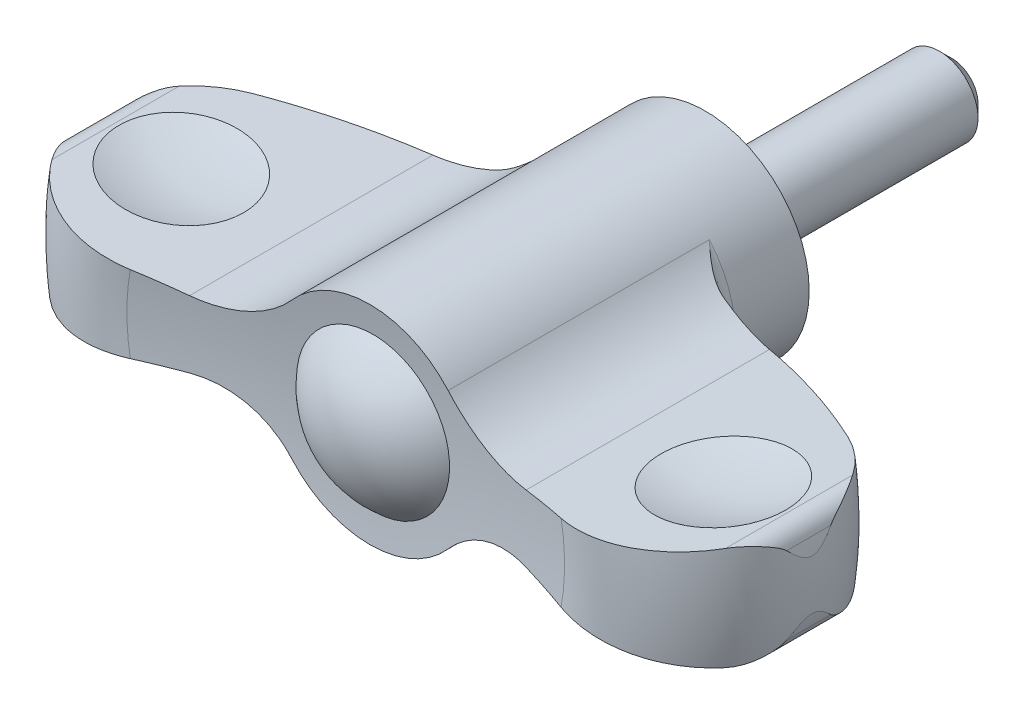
ISO-10303-21;
HEADER;
FILE_DESCRIPTION(('STEP AP214'),'2;1');
FILE_NAME('part.step','',(''),(''),'','','');
FILE_SCHEMA(('AUTOMOTIVE_DESIGN { 1 0 10303 214 1 1 1 1 }'));
ENDSEC;
DATA;
#1=APPLICATION_CONTEXT('core data for automotive mechanical design processes');
#2=APPLICATION_PROTOCOL_DEFINITION('international standard','automotive_design',2000,#1);
#3=PRODUCT_CONTEXT('',#1,'mechanical');
#4=PRODUCT('Part','Part','',(#3));
#5=PRODUCT_RELATED_PRODUCT_CATEGORY('part','',(#4));
#6=PRODUCT_DEFINITION_FORMATION('','',#4);
#7=PRODUCT_DEFINITION_CONTEXT('part definition',#1,'design');
#8=PRODUCT_DEFINITION('design','',#6,#7);
#9=PRODUCT_DEFINITION_SHAPE('','',#8);
#10=(LENGTH_UNIT() NAMED_UNIT(*) SI_UNIT(.MILLI.,.METRE.));
#11=(NAMED_UNIT(*) PLANE_ANGLE_UNIT() SI_UNIT($,.RADIAN.));
#12=(NAMED_UNIT(*) SI_UNIT($,.STERADIAN.) SOLID_ANGLE_UNIT());
#13=UNCERTAINTY_MEASURE_WITH_UNIT(LENGTH_MEASURE(1.E-05),#10,'distance_accuracy_value','');
#14=(GEOMETRIC_REPRESENTATION_CONTEXT(3) GLOBAL_UNCERTAINTY_ASSIGNED_CONTEXT((#13)) GLOBAL_UNIT_ASSIGNED_CONTEXT((#10,
#11,#12)) REPRESENTATION_CONTEXT('',''));
#15=CARTESIAN_POINT('',(0.,0.,0.));
#16=DIRECTION('',(0.,0.,1.));
#17=DIRECTION('',(1.,0.,0.));
#18=AXIS2_PLACEMENT_3D('',#15,#16,#17);
#19=CARTESIAN_POINT('',(0.,0.,72.3));
#20=DIRECTION('',(0.,0.,-1.));
#21=DIRECTION('',(1.,0.,0.));
#22=AXIS2_PLACEMENT_3D('',#19,#20,#21);
#23=SPHERICAL_SURFACE('',#22,51.);
#24=CARTESIAN_POINT('',(0.106101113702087,-0.984705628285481,72.3));
#25=DIRECTION('',(-0.107128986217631,0.994245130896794,0.));
#26=DIRECTION('',(-0.994245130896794,-0.107128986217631,0.));
#27=AXIS2_PLACEMENT_3D('',#24,#25,#26);
#28=CIRCLE('',#27,50.9903824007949);
#29=CARTESIAN_POINT('',(-13.9736878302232,-2.50178976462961,23.3155422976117));
#30=VERTEX_POINT('',#29);
#31=CARTESIAN_POINT('',(-10.91666942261,-2.17239888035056,22.529456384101));
#32=VERTEX_POINT('',#31);
#33=EDGE_CURVE('E30',#30,#32,#28,.F.);
#34=ORIENTED_EDGE('',*,*,#33,.T.);
#35=CARTESIAN_POINT('',(-10.91686942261,-2.17242043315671,22.5295011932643));
#36=CARTESIAN_POINT('',(-10.7296469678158,-2.15222267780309,22.4875506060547));
#37=CARTESIAN_POINT('',(-10.5413017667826,-2.13980901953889,22.4468208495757));
#38=CARTESIAN_POINT('',(-10.1636425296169,-2.13069190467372,22.3680695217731));
#39=CARTESIAN_POINT('',(-9.97432836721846,-2.13399055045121,22.3300483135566));
#40=CARTESIAN_POINT('',(-9.59601268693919,-2.15644826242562,22.2569830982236));
#41=CARTESIAN_POINT('',(-9.40701125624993,-2.17561118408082,22.2219398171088));
#42=CARTESIAN_POINT('',(-9.03072706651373,-2.22980411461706,22.1550981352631));
#43=CARTESIAN_POINT('',(-8.84344419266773,-2.26483305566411,22.1232995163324));
#44=CARTESIAN_POINT('',(-8.47162022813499,-2.35072423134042,22.063129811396));
#45=CARTESIAN_POINT('',(-8.2870846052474,-2.40161451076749,22.034764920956));
#46=CARTESIAN_POINT('',(-7.92248584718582,-2.51896555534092,21.9817487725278));
#47=CARTESIAN_POINT('',(-7.7424225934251,-2.5854259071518,21.9570974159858));
#48=CARTESIAN_POINT('',(-7.38832723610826,-2.7334638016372,21.9117265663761));
#49=CARTESIAN_POINT('',(-7.21428915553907,-2.81502582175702,21.8910030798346));
#50=CARTESIAN_POINT('',(-6.87341920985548,-2.99279306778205,21.8536266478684));
#51=CARTESIAN_POINT('',(-6.70658636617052,-3.08899629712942,21.836973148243));
#52=CARTESIAN_POINT('',(-6.40782206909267,-3.27863643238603,21.8102333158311));
#53=CARTESIAN_POINT('',(-6.27461901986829,-3.36999069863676,21.7995199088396));
#54=CARTESIAN_POINT('',(-6.01493123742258,-3.56204909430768,21.7811068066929));
#55=CARTESIAN_POINT('',(-5.88844563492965,-3.66275200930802,21.7734067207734));
#56=CARTESIAN_POINT('',(-5.64271699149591,-3.87314316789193,21.7610572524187));
#57=CARTESIAN_POINT('',(-5.52348434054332,-3.98284379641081,21.7564121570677));
#58=CARTESIAN_POINT('',(-5.29308424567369,-4.2105332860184,21.7502131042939));
#59=CARTESIAN_POINT('',(-5.18191832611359,-4.32852370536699,21.7486597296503));
#60=CARTESIAN_POINT('',(-5.07512339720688,-4.4503508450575,21.7486647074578));
#61=B_SPLINE_CURVE_WITH_KNOTS('',3,(#35,#36,#37,#38,#39,#40,#41,#42,#43,#44,#45,#46,#47,#48,#49,
#50,#51,#52,#53,#54,#55,#56,#57,#58,#59,#60),.UNSPECIFIED.,.F.,.F.,(4,2,2,2,2,2,2,2,2,2,2,2,4),
(0.,0.578626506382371,1.15733043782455,1.73617505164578,2.31498071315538,2.89481563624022,
3.47463516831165,4.05386199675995,4.63300990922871,5.1182130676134,5.60335328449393,
6.08917285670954,6.57508399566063),.UNSPECIFIED.);
#62=CARTESIAN_POINT('',(-5.07529875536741,-4.4501508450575,21.7486647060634));
#63=VERTEX_POINT('',#62);
#64=EDGE_CURVE('E34',#32,#63,#61,.T.);
#65=ORIENTED_EDGE('',*,*,#64,.T.);
#66=CARTESIAN_POINT('',(0.,0.,21.7486647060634));
#67=DIRECTION('',(0.,0.,1.));
#68=DIRECTION('',(1.,0.,0.));
#69=AXIS2_PLACEMENT_3D('',#66,#67,#68);
#70=CIRCLE('',#69,6.75);
#71=CARTESIAN_POINT('',(5.07529875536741,-4.4501508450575,21.7486647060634));
#72=VERTEX_POINT('',#71);
#73=EDGE_CURVE('E350',#63,#72,#70,.T.);
#74=ORIENTED_EDGE('',*,*,#73,.T.);
#75=CARTESIAN_POINT('',(5.07512339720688,-4.4503508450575,21.7486647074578));
#76=CARTESIAN_POINT('',(5.19811151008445,-4.31003841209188,21.7486568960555));
#77=CARTESIAN_POINT('',(5.32690563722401,-4.1748233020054,21.750718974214));
#78=CARTESIAN_POINT('',(5.59507822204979,-3.91549700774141,21.7589403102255));
#79=CARTESIAN_POINT('',(5.73445549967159,-3.79138458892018,21.7650991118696));
#80=CARTESIAN_POINT('',(6.0224023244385,-3.55546265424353,21.7814490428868));
#81=CARTESIAN_POINT('',(6.17094583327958,-3.44362058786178,21.7916291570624));
#82=CARTESIAN_POINT('',(6.47646460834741,-3.23260452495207,21.8159402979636));
#83=CARTESIAN_POINT('',(6.63343982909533,-3.13343046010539,21.8300713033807));
#84=CARTESIAN_POINT('',(6.9547027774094,-2.94837494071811,21.8621786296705));
#85=CARTESIAN_POINT('',(7.11899194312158,-2.86249611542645,21.8801557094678));
#86=CARTESIAN_POINT('',(7.45373433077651,-2.70454154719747,21.9198257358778));
#87=CARTESIAN_POINT('',(7.62419031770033,-2.63247208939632,21.9415203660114));
#88=CARTESIAN_POINT('',(7.9700647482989,-2.50255377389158,21.9884706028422));
#89=CARTESIAN_POINT('',(8.14548582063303,-2.44471261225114,22.013728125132));
#90=CARTESIAN_POINT('',(8.49988931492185,-2.34360925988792,22.0675996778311));
#91=CARTESIAN_POINT('',(8.67887012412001,-2.30034061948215,22.0962122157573));
#92=CARTESIAN_POINT('',(9.02900148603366,-2.2305564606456,22.1548846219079));
#93=CARTESIAN_POINT('',(9.20002034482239,-2.20322989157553,22.1847703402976));
#94=CARTESIAN_POINT('',(9.54316942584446,-2.1617212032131,22.2471706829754));
#95=CARTESIAN_POINT('',(9.7152996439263,-2.14753903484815,22.2796852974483));
#96=CARTESIAN_POINT('',(10.0596012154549,-2.13229985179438,22.3471369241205));
#97=CARTESIAN_POINT('',(10.2317725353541,-2.13123840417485,22.382073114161));
#98=CARTESIAN_POINT('',(10.5752280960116,-2.14211213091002,22.4541699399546));
#99=CARTESIAN_POINT('',(10.746512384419,-2.154046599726,22.4913304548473));
#100=CARTESIAN_POINT('',(10.91686942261,-2.17242043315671,22.5295011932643));
#101=B_SPLINE_CURVE_WITH_KNOTS('',3,(#75,#76,#77,#78,#79,#80,#81,#82,#83,#84,#85,#86,#87,#88,
#89,#90,#91,#92,#93,#94,#95,#96,#97,#98,#99,#100),.UNSPECIFIED.,.F.,.F.,(4,2,2,2,2,2,2,2,2,2,2,
2,4),(0.,0.559574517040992,1.11908673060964,1.67707683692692,2.2350639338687,2.79316123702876,
3.35151194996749,3.91016401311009,4.46856849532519,4.99529953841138,5.52202861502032,
6.04857972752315,6.57510225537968),.UNSPECIFIED.);
#102=CARTESIAN_POINT('',(10.91666942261,-2.17239888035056,22.529456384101));
#103=VERTEX_POINT('',#102);
#104=EDGE_CURVE('E343',#72,#103,#101,.T.);
#105=ORIENTED_EDGE('',*,*,#104,.T.);
#106=CARTESIAN_POINT('',(-0.10610111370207,-0.984705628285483,72.3));
#107=DIRECTION('',(0.107128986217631,0.994245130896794,0.));
#108=DIRECTION('',(-0.994245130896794,0.107128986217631,0.));
#109=AXIS2_PLACEMENT_3D('',#106,#107,#108);
#110=CIRCLE('',#109,50.9903824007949);
#111=CARTESIAN_POINT('',(13.9736878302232,-2.50178976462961,23.3155422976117));
#112=VERTEX_POINT('',#111);
#113=EDGE_CURVE('E351',#103,#112,#110,.F.);
#114=ORIENTED_EDGE('',*,*,#113,.T.);
#115=CARTESIAN_POINT('',(0.,0.,23.3155422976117));
#116=DIRECTION('',(0.,0.,-1.));
#117=DIRECTION('',(-1.,0.,0.));
#118=AXIS2_PLACEMENT_3D('',#115,#116,#117);
#119=CIRCLE('',#118,14.1958762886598);
#120=CARTESIAN_POINT('',(13.9736878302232,2.50178976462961,23.3155422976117));
#121=VERTEX_POINT('',#120);
#122=EDGE_CURVE('E186',#121,#112,#119,.T.);
#123=ORIENTED_EDGE('',*,*,#122,.F.);
#124=CARTESIAN_POINT('',(-0.10610111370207,0.984705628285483,72.3));
#125=DIRECTION('',(0.107128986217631,-0.994245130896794,0.));
#126=DIRECTION('',(0.994245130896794,0.107128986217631,0.));
#127=AXIS2_PLACEMENT_3D('',#124,#125,#126);
#128=CIRCLE('',#127,50.9903824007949);
#129=CARTESIAN_POINT('',(10.91666942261,2.17239888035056,22.529456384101));
#130=VERTEX_POINT('',#129);
#131=EDGE_CURVE('E370',#121,#130,#128,.F.);
#132=ORIENTED_EDGE('',*,*,#131,.T.);
#133=CARTESIAN_POINT('',(10.91686942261,2.17242043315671,22.5295011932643));
#134=CARTESIAN_POINT('',(10.7296469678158,2.15222267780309,22.4875506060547));
#135=CARTESIAN_POINT('',(10.5413017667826,2.13980901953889,22.4468208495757));
#136=CARTESIAN_POINT('',(10.1636425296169,2.13069190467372,22.3680695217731));
#137=CARTESIAN_POINT('',(9.97432836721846,2.13399055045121,22.3300483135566));
#138=CARTESIAN_POINT('',(9.59601268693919,2.15644826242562,22.2569830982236));
#139=CARTESIAN_POINT('',(9.40701125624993,2.17561118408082,22.2219398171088));
#140=CARTESIAN_POINT('',(9.03072706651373,2.22980411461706,22.1550981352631));
#141=CARTESIAN_POINT('',(8.84344419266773,2.26483305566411,22.1232995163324));
#142=CARTESIAN_POINT('',(8.47162022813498,2.35072423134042,22.063129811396));
#143=CARTESIAN_POINT('',(8.2870846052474,2.40161451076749,22.034764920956));
#144=CARTESIAN_POINT('',(7.92248584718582,2.51896555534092,21.9817487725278));
#145=CARTESIAN_POINT('',(7.7424225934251,2.5854259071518,21.9570974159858));
#146=CARTESIAN_POINT('',(7.38832723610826,2.7334638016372,21.9117265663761));
#147=CARTESIAN_POINT('',(7.21428915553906,2.81502582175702,21.8910030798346));
#148=CARTESIAN_POINT('',(6.87341920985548,2.99279306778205,21.8536266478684));
#149=CARTESIAN_POINT('',(6.70658636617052,3.08899629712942,21.836973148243));
#150=CARTESIAN_POINT('',(6.40782206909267,3.27863643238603,21.8102333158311));
#151=CARTESIAN_POINT('',(6.27461901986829,3.36999069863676,21.7995199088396));
#152=CARTESIAN_POINT('',(6.01493123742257,3.56204909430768,21.7811068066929));
#153=CARTESIAN_POINT('',(5.88844563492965,3.66275200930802,21.7734067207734));
#154=CARTESIAN_POINT('',(5.64271699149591,3.87314316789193,21.7610572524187));
#155=CARTESIAN_POINT('',(5.52348434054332,3.98284379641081,21.7564121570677));
#156=CARTESIAN_POINT('',(5.29308424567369,4.2105332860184,21.7502131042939));
#157=CARTESIAN_POINT('',(5.18191832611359,4.32852370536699,21.7486597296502));
#158=CARTESIAN_POINT('',(5.07512339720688,4.4503508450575,21.7486647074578));
#159=B_SPLINE_CURVE_WITH_KNOTS('',3,(#133,#134,#135,#136,#137,#138,#139,#140,#141,#142,#143,
#144,#145,#146,#147,#148,#149,#150,#151,#152,#153,#154,#155,#156,#157,#158),.UNSPECIFIED.,.F.,
.F.,(4,2,2,2,2,2,2,2,2,2,2,2,4),(0.,0.578626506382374,1.15733043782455,1.73617505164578,
2.31498071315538,2.89481563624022,3.47463516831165,4.05386199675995,4.63300990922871,
5.1182130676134,5.60335328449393,6.08917285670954,6.57508399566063),.UNSPECIFIED.);
#160=CARTESIAN_POINT('',(5.07529875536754,4.45015084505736,21.7486647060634));
#161=VERTEX_POINT('',#160);
#162=EDGE_CURVE('E320',#130,#161,#159,.T.);
#163=ORIENTED_EDGE('',*,*,#162,.T.);
#164=CARTESIAN_POINT('',(0.,0.,21.7486647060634));
#165=DIRECTION('',(0.,0.,1.));
#166=DIRECTION('',(1.,0.,0.));
#167=AXIS2_PLACEMENT_3D('',#164,#165,#166);
#168=CIRCLE('',#167,6.75);
#169=CARTESIAN_POINT('',(-5.07529875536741,4.4501508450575,21.7486647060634));
#170=VERTEX_POINT('',#169);
#171=EDGE_CURVE('E326',#161,#170,#168,.T.);
#172=ORIENTED_EDGE('',*,*,#171,.T.);
#173=CARTESIAN_POINT('',(-5.07512339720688,4.4503508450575,21.7486647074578));
#174=CARTESIAN_POINT('',(-5.19811151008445,4.31003841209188,21.7486568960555));
#175=CARTESIAN_POINT('',(-5.32690563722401,4.1748233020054,21.750718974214));
#176=CARTESIAN_POINT('',(-5.59507822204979,3.91549700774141,21.7589403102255));
#177=CARTESIAN_POINT('',(-5.73445549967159,3.79138458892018,21.7650991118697));
#178=CARTESIAN_POINT('',(-6.0224023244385,3.55546265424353,21.7814490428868));
#179=CARTESIAN_POINT('',(-6.17094583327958,3.44362058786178,21.7916291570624));
#180=CARTESIAN_POINT('',(-6.47646460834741,3.23260452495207,21.8159402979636));
#181=CARTESIAN_POINT('',(-6.63343982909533,3.13343046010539,21.8300713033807));
#182=CARTESIAN_POINT('',(-6.9547027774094,2.94837494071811,21.8621786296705));
#183=CARTESIAN_POINT('',(-7.11899194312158,2.86249611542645,21.8801557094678));
#184=CARTESIAN_POINT('',(-7.45373433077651,2.70454154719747,21.9198257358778));
#185=CARTESIAN_POINT('',(-7.62419031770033,2.63247208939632,21.9415203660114));
#186=CARTESIAN_POINT('',(-7.9700647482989,2.50255377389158,21.9884706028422));
#187=CARTESIAN_POINT('',(-8.14548582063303,2.44471261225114,22.013728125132));
#188=CARTESIAN_POINT('',(-8.49988931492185,2.34360925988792,22.0675996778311));
#189=CARTESIAN_POINT('',(-8.67887012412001,2.30034061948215,22.0962122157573));
#190=CARTESIAN_POINT('',(-9.02900148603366,2.2305564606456,22.1548846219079));
#191=CARTESIAN_POINT('',(-9.20002034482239,2.20322989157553,22.1847703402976));
#192=CARTESIAN_POINT('',(-9.54316942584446,2.1617212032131,22.2471706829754));
#193=CARTESIAN_POINT('',(-9.7152996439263,2.14753903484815,22.2796852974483));
#194=CARTESIAN_POINT('',(-10.0596012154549,2.13229985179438,22.3471369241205));
#195=CARTESIAN_POINT('',(-10.2317725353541,2.13123840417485,22.382073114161));
#196=CARTESIAN_POINT('',(-10.5752280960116,2.14211213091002,22.4541699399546));
#197=CARTESIAN_POINT('',(-10.746512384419,2.154046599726,22.4913304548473));
#198=CARTESIAN_POINT('',(-10.91686942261,2.17242043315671,22.5295011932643));
#199=B_SPLINE_CURVE_WITH_KNOTS('',3,(#173,#174,#175,#176,#177,#178,#179,#180,#181,#182,#183,
#184,#185,#186,#187,#188,#189,#190,#191,#192,#193,#194,#195,#196,#197,#198),.UNSPECIFIED.,.F.,
.F.,(4,2,2,2,2,2,2,2,2,2,2,2,4),(0.,0.559574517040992,1.11908673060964,1.67707683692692,
2.2350639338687,2.79316123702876,3.35151194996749,3.91016401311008,4.46856849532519,
4.99529953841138,5.52202861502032,6.04857972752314,6.57510225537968),.UNSPECIFIED.);
#200=CARTESIAN_POINT('',(-10.91666942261,2.17239888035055,22.529456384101));
#201=VERTEX_POINT('',#200);
#202=EDGE_CURVE('E191',#170,#201,#199,.T.);
#203=ORIENTED_EDGE('',*,*,#202,.T.);
#204=CARTESIAN_POINT('',(0.106101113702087,0.984705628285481,72.3));
#205=DIRECTION('',(-0.107128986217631,-0.994245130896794,0.));
#206=DIRECTION('',(0.994245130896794,-0.107128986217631,0.));
#207=AXIS2_PLACEMENT_3D('',#204,#205,#206);
#208=CIRCLE('',#207,50.9903824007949);
#209=CARTESIAN_POINT('',(-13.9736878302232,2.50178976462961,23.3155422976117));
#210=VERTEX_POINT('',#209);
#211=EDGE_CURVE('E443',#201,#210,#208,.F.);
#212=ORIENTED_EDGE('',*,*,#211,.T.);
#213=EDGE_CURVE('E492',#30,#210,#119,.T.);
#214=ORIENTED_EDGE('',*,*,#213,.F.);
#215=EDGE_LOOP('',(#34,#65,#74,#105,#114,#123,#132,#163,#172,#203,#212,#214));
#216=FACE_BOUND('',#215,.T.);
#217=CARTESIAN_POINT('',(0.,0.,21.5419708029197));
#218=DIRECTION('',(0.,0.,-1.));
#219=DIRECTION('',(-1.,0.,0.));
#220=AXIS2_PLACEMENT_3D('',#217,#218,#219);
#221=CIRCLE('',#220,4.96210358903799);
#222=CARTESIAN_POINT('',(-4.96210358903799,0.,21.5419708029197));
#223=VERTEX_POINT('',#222);
#224=EDGE_CURVE('E383',#223,#223,#221,.T.);
#225=ORIENTED_EDGE('',*,*,#224,.T.);
#226=EDGE_LOOP('',(#225));
#227=FACE_BOUND('',#226,.T.);
#228=ADVANCED_FACE('F14',(#216,#227),#23,.F.);
#229=CARTESIAN_POINT('',(-10.91666942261,-2.17239888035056,24.));
#230=DIRECTION('',(-0.107128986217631,0.994245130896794,0.));
#231=DIRECTION('',(-0.994245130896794,-0.107128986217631,0.));
#232=AXIS2_PLACEMENT_3D('',#229,#230,#231);
#233=PLANE('',#232);
#234=ORIENTED_EDGE('',*,*,#33,.F.);
#235=CARTESIAN_POINT('',(-21.8457309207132,-3.34999507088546,20.5252646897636));
#236=CARTESIAN_POINT('',(-21.7302435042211,-3.33755140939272,20.6912978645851));
#237=CARTESIAN_POINT('',(-21.6077536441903,-3.32435324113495,20.8523984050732));
#238=CARTESIAN_POINT('',(-21.3497248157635,-3.29655087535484,21.1636425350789));
#239=CARTESIAN_POINT('',(-21.2141865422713,-3.28194675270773,21.3137867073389));
#240=CARTESIAN_POINT('',(-20.9311105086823,-3.25144557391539,21.6019360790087));
#241=CARTESIAN_POINT('',(-20.783581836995,-3.23554949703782,21.7399503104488));
#242=CARTESIAN_POINT('',(-20.4774952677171,-3.20256895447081,22.0029918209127));
#243=CARTESIAN_POINT('',(-20.3189374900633,-3.18548450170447,22.1280192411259));
#244=CARTESIAN_POINT('',(-19.9918782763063,-3.15024417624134,22.3642331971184));
#245=CARTESIAN_POINT('',(-19.8233743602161,-3.13208803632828,22.4754162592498));
#246=CARTESIAN_POINT('',(-19.4775952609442,-3.09483066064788,22.6831586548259));
#247=CARTESIAN_POINT('',(-19.3003168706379,-3.07572907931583,22.7797125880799));
#248=CARTESIAN_POINT('',(-18.9383738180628,-3.0367300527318,22.9574348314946));
#249=CARTESIAN_POINT('',(-18.7537118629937,-3.01683289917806,23.0386087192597));
#250=CARTESIAN_POINT('',(-18.3782492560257,-2.97637715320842,23.1850463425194));
#251=CARTESIAN_POINT('',(-18.1874484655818,-2.95581854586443,23.2503097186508));
#252=CARTESIAN_POINT('',(-17.8008818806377,-2.91416635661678,23.3645224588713));
#253=CARTESIAN_POINT('',(-17.6051115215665,-2.89307228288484,23.4134561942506));
#254=CARTESIAN_POINT('',(-17.2101714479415,-2.85051785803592,23.4945837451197));
#255=CARTESIAN_POINT('',(-17.011001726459,-2.82905750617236,23.5267775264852));
#256=CARTESIAN_POINT('',(-16.6106619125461,-2.78592126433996,23.5742057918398));
#257=CARTESIAN_POINT('',(-16.4094916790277,-2.76424535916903,23.589439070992));
#258=CARTESIAN_POINT('',(-16.006594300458,-2.72083354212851,23.6028415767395));
#259=CARTESIAN_POINT('',(-15.804867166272,-2.69909763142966,23.6010111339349));
#260=CARTESIAN_POINT('',(-15.4019677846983,-2.65568559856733,23.5802910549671));
#261=CARTESIAN_POINT('',(-15.2007968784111,-2.63400962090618,23.5613750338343));
#262=CARTESIAN_POINT('',(-14.8008192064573,-2.59091239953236,23.5065973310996));
#263=CARTESIAN_POINT('',(-14.6020116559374,-2.56949107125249,23.47074144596));
#264=CARTESIAN_POINT('',(-14.2079744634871,-2.52703393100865,23.3823184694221));
#265=CARTESIAN_POINT('',(-14.0127471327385,-2.50599836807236,23.3297409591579));
#266=CARTESIAN_POINT('',(-13.6273876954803,-2.46447624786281,23.208260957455));
#267=CARTESIAN_POINT('',(-13.4372553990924,-2.44398967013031,23.1393590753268));
#268=CARTESIAN_POINT('',(-13.0629639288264,-2.40366011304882,22.985531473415));
#269=CARTESIAN_POINT('',(-12.8788206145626,-2.38381884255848,22.9005667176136));
#270=CARTESIAN_POINT('',(-12.5183119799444,-2.34497437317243,22.7153302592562));
#271=CARTESIAN_POINT('',(-12.3419464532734,-2.3259711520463,22.6150589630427));
#272=CARTESIAN_POINT('',(-11.9985630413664,-2.28897190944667,22.400122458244));
#273=CARTESIAN_POINT('',(-11.8315288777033,-2.27097413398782,22.2854835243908));
#274=CARTESIAN_POINT('',(-11.5077189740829,-2.23608391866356,22.0425218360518));
#275=CARTESIAN_POINT('',(-11.3509370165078,-2.21919080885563,21.9142075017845));
#276=CARTESIAN_POINT('',(-11.1514082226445,-2.19769176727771,21.7363546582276));
#277=CARTESIAN_POINT('',(-11.1035524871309,-2.19253535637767,21.6925222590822));
#278=CARTESIAN_POINT('',(-11.0090859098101,-2.18235667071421,21.6036210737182));
#279=CARTESIAN_POINT('',(-10.9624737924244,-2.17733425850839,21.5585536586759));
#280=CARTESIAN_POINT('',(-10.91646942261,-2.17237733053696,21.5128574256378));
#281=B_SPLINE_CURVE_WITH_KNOTS('',3,(#235,#236,#237,#238,#239,#240,#241,#242,#243,#244,#245,
#246,#247,#248,#249,#250,#251,#252,#253,#254,#255,#256,#257,#258,#259,#260,#261,#262,#263,#264,
#265,#266,#267,#268,#269,#270,#271,#272,#273,#274,#275,#276,#277,#278,#279,#280),.UNSPECIFIED.,
.F.,.F.,(4,2,2,2,2,2,2,2,2,2,2,2,2,2,2,2,2,2,2,2,2,2,4),(0.,0.607705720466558,1.21537909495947,
1.82259608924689,2.42980648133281,3.03716892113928,3.64475501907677,4.25212035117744,
4.85949940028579,5.46745810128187,6.07541804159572,6.68342116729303,7.29141251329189,
7.90034437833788,8.50906803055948,9.11817171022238,9.72725265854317,10.3378332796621,
10.9483976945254,11.557861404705,12.166952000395,12.3622359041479,12.5573111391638),.UNSPECIFIED.);
#282=CARTESIAN_POINT('',(-21.8455309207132,-3.34997352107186,20.5255521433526));
#283=VERTEX_POINT('',#282);
#284=EDGE_CURVE('E851',#283,#30,#281,.T.);
#285=ORIENTED_EDGE('',*,*,#284,.F.);
#286=DIRECTION('',(0.,0.,-1.));
#287=VECTOR('',#286,1.);
#288=CARTESIAN_POINT('',(-21.8455309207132,-3.34997352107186,24.));
#289=LINE('',#288,#287);
#290=CARTESIAN_POINT('',(-21.8455309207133,-3.34997352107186,12.2746267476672));
#291=VERTEX_POINT('',#290);
#292=EDGE_CURVE('E462',#283,#291,#289,.T.);
#293=ORIENTED_EDGE('',*,*,#292,.T.);
#294=CARTESIAN_POINT('',(-19.2945778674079,-3.07511070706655,10.0206583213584));
#295=CARTESIAN_POINT('',(-19.4747975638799,-3.09452921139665,10.1153575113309));
#296=CARTESIAN_POINT('',(-19.6509896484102,-3.11351374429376,10.2178086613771));
#297=CARTESIAN_POINT('',(-19.9941575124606,-3.15048976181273,10.4374340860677));
#298=CARTESIAN_POINT('',(-20.1611295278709,-3.16848084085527,10.55461431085));
#299=CARTESIAN_POINT('',(-20.4813600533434,-3.20298538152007,10.8003921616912));
#300=CARTESIAN_POINT('',(-20.6348240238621,-3.21952098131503,10.9287191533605));
#301=CARTESIAN_POINT('',(-20.9305024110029,-3.25138005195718,11.1977390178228));
#302=CARTESIAN_POINT('',(-21.0727226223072,-3.26670414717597,11.3384254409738));
#303=CARTESIAN_POINT('',(-21.3235946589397,-3.29373537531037,11.608219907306));
#304=CARTESIAN_POINT('',(-21.43401009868,-3.3056325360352,11.7356749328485));
#305=CARTESIAN_POINT('',(-21.6465578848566,-3.32853436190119,11.9991858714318));
#306=CARTESIAN_POINT('',(-21.7486121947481,-3.33953061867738,12.135305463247));
#307=CARTESIAN_POINT('',(-21.8457309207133,-3.34999507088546,12.2749142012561));
#308=B_SPLINE_CURVE_WITH_KNOTS('',3,(#294,#295,#296,#297,#298,#299,#300,#301,#302,#303,#304,
#305,#306,#307),.UNSPECIFIED.,.F.,.F.,(4,2,2,2,2,2,4),(0.,0.613344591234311,1.22693775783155,
1.82843414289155,2.42961848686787,2.93636077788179,3.44739305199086),.UNSPECIFIED.);
#309=CARTESIAN_POINT('',(-19.2949583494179,-3.07515170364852,10.0208583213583));
#310=VERTEX_POINT('',#309);
#311=EDGE_CURVE('E853',#310,#291,#308,.T.);
#312=ORIENTED_EDGE('',*,*,#311,.F.);
#313=CARTESIAN_POINT('',(-10.91646942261,-2.17237733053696,6.74022888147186));
#314=CARTESIAN_POINT('',(-11.6429801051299,-2.2506581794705,6.93529272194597));
#315=CARTESIAN_POINT('',(-12.3641189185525,-2.32836021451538,7.15058575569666));
#316=CARTESIAN_POINT('',(-13.791310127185,-2.48213873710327,7.62017172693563));
#317=CARTESIAN_POINT('',(-14.4974016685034,-2.558219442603,7.87434431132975));
#318=CARTESIAN_POINT('',(-15.8945921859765,-2.70876541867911,8.42142446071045));
#319=CARTESIAN_POINT('',(-16.5856911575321,-2.78323068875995,8.71433203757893));
#320=CARTESIAN_POINT('',(-17.9528888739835,-2.93054496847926,9.33891493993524));
#321=CARTESIAN_POINT('',(-18.6289355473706,-3.0033883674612,9.67070557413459));
#322=CARTESIAN_POINT('',(-19.2953387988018,-3.07519269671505,10.0210583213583));
#323=B_SPLINE_CURVE_WITH_KNOTS('',3,(#313,#314,#315,#316,#317,#318,#319,#320,#321,#322),
.UNSPECIFIED.,.F.,.F.,(4,2,2,2,4),(0.,2.26861905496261,4.53035255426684,6.79208674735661,
9.06070650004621),.UNSPECIFIED.);
#324=CARTESIAN_POINT('',(-10.91666942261,-2.17239888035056,6.74028258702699));
#325=VERTEX_POINT('',#324);
#326=EDGE_CURVE('E268',#325,#310,#323,.T.);
#327=ORIENTED_EDGE('',*,*,#326,.F.);
#328=DIRECTION('',(0.,0.,-1.));
#329=VECTOR('',#328,1.);
#330=CARTESIAN_POINT('',(-10.91666942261,-2.17239888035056,24.));
#331=LINE('',#330,#329);
#332=EDGE_CURVE('E459',#32,#325,#331,.T.);
#333=ORIENTED_EDGE('',*,*,#332,.F.);
#334=EDGE_LOOP('',(#234,#285,#293,#312,#327,#333));
#335=FACE_BOUND('',#334,.T.);
#336=CARTESIAN_POINT('',(-17.5815922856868,-2.89053810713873,16.4));
#337=DIRECTION('',(-0.107128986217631,0.994245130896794,0.));
#338=DIRECTION('',(-0.994245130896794,-0.107128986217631,0.));
#339=AXIS2_PLACEMENT_3D('',#336,#337,#338);
#340=CIRCLE('',#339,4.06502356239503);
#341=CARTESIAN_POINT('',(-21.6232221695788,-3.3260199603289,16.4));
#342=VERTEX_POINT('',#341);
#343=EDGE_CURVE('E380',#342,#342,#340,.F.);
#344=ORIENTED_EDGE('',*,*,#343,.F.);
#345=EDGE_LOOP('',(#344));
#346=FACE_BOUND('',#345,.T.);
#347=ADVANCED_FACE('F292',(#335,#346),#233,.F.);
#348=CARTESIAN_POINT('',(-10.91666942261,2.17239888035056,24.));
#349=DIRECTION('',(-0.107128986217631,-0.994245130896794,0.));
#350=DIRECTION('',(0.994245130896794,-0.107128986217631,0.));
#351=AXIS2_PLACEMENT_3D('',#348,#349,#350);
#352=PLANE('',#351);
#353=ORIENTED_EDGE('',*,*,#211,.F.);
#354=DIRECTION('',(0.,0.,-1.));
#355=VECTOR('',#354,1.);
#356=CARTESIAN_POINT('',(-10.91666942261,2.17239888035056,24.));
#357=LINE('',#356,#355);
#358=CARTESIAN_POINT('',(-10.91666942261,2.17239888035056,6.74028258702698));
#359=VERTEX_POINT('',#358);
#360=EDGE_CURVE('E193',#201,#359,#357,.T.);
#361=ORIENTED_EDGE('',*,*,#360,.T.);
#362=CARTESIAN_POINT('',(-19.2953387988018,3.07519269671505,10.0210583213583));
#363=CARTESIAN_POINT('',(-18.6289355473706,3.0033883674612,9.67070557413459));
#364=CARTESIAN_POINT('',(-17.9528888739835,2.93054496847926,9.33891493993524));
#365=CARTESIAN_POINT('',(-16.5856911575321,2.78323068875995,8.71433203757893));
#366=CARTESIAN_POINT('',(-15.8945921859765,2.70876541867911,8.42142446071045));
#367=CARTESIAN_POINT('',(-14.4974016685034,2.558219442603,7.87434431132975));
#368=CARTESIAN_POINT('',(-13.791310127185,2.48213873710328,7.62017172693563));
#369=CARTESIAN_POINT('',(-12.3641189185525,2.32836021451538,7.15058575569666));
#370=CARTESIAN_POINT('',(-11.6429801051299,2.2506581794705,6.93529272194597));
#371=CARTESIAN_POINT('',(-10.91646942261,2.17237733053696,6.74022888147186));
#372=B_SPLINE_CURVE_WITH_KNOTS('',3,(#362,#363,#364,#365,#366,#367,#368,#369,#370,#371),
.UNSPECIFIED.,.F.,.F.,(4,2,2,2,4),(0.,2.2686197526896,4.53035394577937,6.7920874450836,
9.06070650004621),.UNSPECIFIED.);
#373=CARTESIAN_POINT('',(-19.2949583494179,3.07515170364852,10.0208583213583));
#374=VERTEX_POINT('',#373);
#375=EDGE_CURVE('E275',#374,#359,#372,.T.);
#376=ORIENTED_EDGE('',*,*,#375,.F.);
#377=CARTESIAN_POINT('',(-16.1316021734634,2.73430302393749,9.20190527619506));
#378=CARTESIAN_POINT('',(-16.3336188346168,2.75607013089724,9.20643915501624));
#379=CARTESIAN_POINT('',(-16.5354410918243,2.777816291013,9.2195877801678));
#380=CARTESIAN_POINT('',(-16.9372607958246,2.82111198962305,9.2629315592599));
#381=CARTESIAN_POINT('',(-17.1372583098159,2.84266153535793,9.29312608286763));
#382=CARTESIAN_POINT('',(-17.53371131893,2.88537897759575,9.37032135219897));
#383=CARTESIAN_POINT('',(-17.7301716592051,2.90654739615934,9.41729692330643));
#384=CARTESIAN_POINT('',(-18.1184556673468,2.94838463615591,9.52772695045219));
#385=CARTESIAN_POINT('',(-18.310279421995,2.9690534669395,9.59118109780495));
#386=CARTESIAN_POINT('',(-18.6875910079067,3.00970843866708,9.73399849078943));
#387=CARTESIAN_POINT('',(-18.8730894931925,3.02969572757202,9.81333326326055));
#388=CARTESIAN_POINT('',(-19.236871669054,3.0688929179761,9.98746420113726));
#389=CARTESIAN_POINT('',(-19.4151520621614,3.08810246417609,10.0822673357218));
#390=CARTESIAN_POINT('',(-19.7631321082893,3.12559698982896,10.2866372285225));
#391=CARTESIAN_POINT('',(-19.9328321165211,3.14388200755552,10.3962033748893));
#392=CARTESIAN_POINT('',(-20.2623750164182,3.17938994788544,10.6292750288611));
#393=CARTESIAN_POINT('',(-20.4222223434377,3.19661334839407,10.7527741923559));
#394=CARTESIAN_POINT('',(-20.7309200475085,3.22987523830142,11.0128081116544));
#395=CARTESIAN_POINT('',(-20.8797763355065,3.24591436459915,11.1493357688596));
#396=CARTESIAN_POINT('',(-21.1655301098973,3.27670406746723,11.4345171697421));
#397=CARTESIAN_POINT('',(-21.3024274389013,3.29145462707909,11.58317107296));
#398=CARTESIAN_POINT('',(-21.5634920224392,3.3195840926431,11.8918051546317));
#399=CARTESIAN_POINT('',(-21.6876381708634,3.33296072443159,12.0518033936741));
#400=CARTESIAN_POINT('',(-21.9220837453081,3.35822201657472,12.3817648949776));
#401=CARTESIAN_POINT('',(-22.0323824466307,3.37010659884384,12.5517286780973));
#402=CARTESIAN_POINT('',(-22.1353199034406,3.3811980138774,12.7260937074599));
#403=B_SPLINE_CURVE_WITH_KNOTS('',3,(#377,#378,#379,#380,#381,#382,#383,#384,#385,#386,#387,
#388,#389,#390,#391,#392,#393,#394,#395,#396,#397,#398,#399,#400,#401,#402),.UNSPECIFIED.,.F.,
.F.,(4,2,2,2,2,2,2,2,2,2,2,2,4),(0.,0.60952472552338,1.21902691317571,1.82761855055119,
2.43619878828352,3.04369749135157,3.65147065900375,4.25921864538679,4.86669101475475,
5.47383427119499,6.080985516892,6.68912606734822,7.29729843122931),.UNSPECIFIED.);
#404=CARTESIAN_POINT('',(-21.845530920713,3.34997352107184,12.2746267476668));
#405=VERTEX_POINT('',#404);
#406=EDGE_CURVE('E302',#405,#374,#403,.F.);
#407=ORIENTED_EDGE('',*,*,#406,.F.);
#408=DIRECTION('',(0.,0.,-1.));
#409=VECTOR('',#408,1.);
#410=CARTESIAN_POINT('',(-21.8455309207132,3.34997352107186,24.));
#411=LINE('',#410,#409);
#412=CARTESIAN_POINT('',(-21.8455309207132,3.34997352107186,20.5255521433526));
#413=VERTEX_POINT('',#412);
#414=EDGE_CURVE('E198',#413,#405,#411,.T.);
#415=ORIENTED_EDGE('',*,*,#414,.F.);
#416=CARTESIAN_POINT('',(-10.91646942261,2.17237733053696,21.5128574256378));
#417=CARTESIAN_POINT('',(-11.060414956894,2.18788732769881,21.6558705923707));
#418=CARTESIAN_POINT('',(-11.2103909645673,2.20404710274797,21.7927365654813));
#419=CARTESIAN_POINT('',(-11.5212615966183,2.23754312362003,22.0532734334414));
#420=CARTESIAN_POINT('',(-11.682155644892,2.25487930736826,22.1769450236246));
#421=CARTESIAN_POINT('',(-12.013622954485,2.29059460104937,22.4101285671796));
#422=CARTESIAN_POINT('',(-12.1841895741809,2.3089729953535,22.5196500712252));
#423=CARTESIAN_POINT('',(-12.5338820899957,2.3466520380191,22.723861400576));
#424=CARTESIAN_POINT('',(-12.7130078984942,2.36595267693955,22.8185513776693));
#425=CARTESIAN_POINT('',(-13.0785959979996,2.40534445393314,22.9924500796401));
#426=CARTESIAN_POINT('',(-13.2650601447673,2.42543579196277,23.0716548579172));
#427=CARTESIAN_POINT('',(-13.6440277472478,2.46626919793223,23.2140153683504));
#428=CARTESIAN_POINT('',(-13.8365334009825,2.48701150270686,23.2771651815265));
#429=CARTESIAN_POINT('',(-14.2260776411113,2.5289845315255,23.3869042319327));
#430=CARTESIAN_POINT('',(-14.4231144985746,2.55021506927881,23.433499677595));
#431=CARTESIAN_POINT('',(-14.8203952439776,2.59302169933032,23.5098273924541));
#432=CARTESIAN_POINT('',(-15.0206391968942,2.6145977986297,23.5395593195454));
#433=CARTESIAN_POINT('',(-15.4229162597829,2.65794277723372,23.581941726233));
#434=CARTESIAN_POINT('',(-15.6249494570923,2.67971166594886,23.5945913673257));
#435=CARTESIAN_POINT('',(-16.0293573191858,2.72328623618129,23.6027094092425));
#436=CARTESIAN_POINT('',(-16.2317319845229,2.74509191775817,23.5981777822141));
#437=CARTESIAN_POINT('',(-16.6353922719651,2.78858593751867,23.5719573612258));
#438=CARTESIAN_POINT('',(-16.8366778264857,2.81027426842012,23.5502675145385));
#439=CARTESIAN_POINT('',(-17.2367059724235,2.85337692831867,23.4898773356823));
#440=CARTESIAN_POINT('',(-17.4354486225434,2.87479126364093,23.451177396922));
#441=CARTESIAN_POINT('',(-17.8286809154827,2.91716167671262,23.3571066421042));
#442=CARTESIAN_POINT('',(-18.0231764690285,2.93811839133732,23.3017608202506));
#443=CARTESIAN_POINT('',(-18.4067663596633,2.97944984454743,23.1747874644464));
#444=CARTESIAN_POINT('',(-18.5958625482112,2.99982478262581,23.1031655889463));
#445=CARTESIAN_POINT('',(-18.9674894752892,3.03986723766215,22.9440840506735));
#446=CARTESIAN_POINT('',(-19.1500160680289,3.05953430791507,22.8566145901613));
#447=CARTESIAN_POINT('',(-19.5070671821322,3.09800623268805,22.6664899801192));
#448=CARTESIAN_POINT('',(-19.6815920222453,3.11681112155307,22.5638354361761));
#449=CARTESIAN_POINT('',(-20.0212685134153,3.15341094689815,22.3441502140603));
#450=CARTESIAN_POINT('',(-20.1864271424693,3.17120663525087,22.2271304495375));
#451=CARTESIAN_POINT('',(-20.5063289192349,3.20567575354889,21.9794851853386));
#452=CARTESIAN_POINT('',(-20.6610723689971,3.22234921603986,21.8488600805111));
#453=CARTESIAN_POINT('',(-20.9587578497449,3.25442454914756,21.5751939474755));
#454=CARTESIAN_POINT('',(-21.1017211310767,3.26982870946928,21.4321762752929));
#455=CARTESIAN_POINT('',(-21.3750859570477,3.29928351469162,21.1345878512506));
#456=CARTESIAN_POINT('',(-21.5054952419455,3.31333499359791,20.9800243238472));
#457=CARTESIAN_POINT('',(-21.6665115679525,3.33068435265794,20.7720063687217));
#458=CARTESIAN_POINT('',(-21.7032508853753,3.3346429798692,20.7232730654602));
#459=CARTESIAN_POINT('',(-21.7754460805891,3.34242194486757,20.6249310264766));
#460=CARTESIAN_POINT('',(-21.8109032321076,3.34624241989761,20.5753232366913));
#461=CARTESIAN_POINT('',(-21.8457309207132,3.34999507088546,20.5252646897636));
#462=B_SPLINE_CURVE_WITH_KNOTS('',3,(#416,#417,#418,#419,#420,#421,#422,#423,#424,#425,#426,
#427,#428,#429,#430,#431,#432,#433,#434,#435,#436,#437,#438,#439,#440,#441,#442,#443,#444,#445,
#446,#447,#448,#449,#450,#451,#452,#453,#454,#455,#456,#457,#458,#459,#460,#461),.UNSPECIFIED.,
.F.,.F.,(4,2,2,2,2,2,2,2,2,2,2,2,2,2,2,2,2,2,2,2,2,2,4),(0.,0.610322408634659,1.22061263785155,
1.83048877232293,2.44035866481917,3.05038378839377,3.66063348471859,4.27065407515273,
4.88068704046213,5.49074994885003,6.10081384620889,6.71091517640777,7.32100239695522,
7.93017809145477,8.5391423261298,9.14848434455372,9.75780206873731,10.3666597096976,
10.9754996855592,11.5832161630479,12.1905555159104,12.3740180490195,12.5572930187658),.UNSPECIFIED.);
#463=EDGE_CURVE('E308',#210,#413,#462,.T.);
#464=ORIENTED_EDGE('',*,*,#463,.F.);
#465=EDGE_LOOP('',(#353,#361,#376,#407,#415,#464));
#466=FACE_BOUND('',#465,.T.);
#467=CARTESIAN_POINT('',(-17.5815922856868,2.89053810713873,16.4));
#468=DIRECTION('',(-0.107128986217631,-0.994245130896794,0.));
#469=DIRECTION('',(0.994245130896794,-0.107128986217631,0.));
#470=AXIS2_PLACEMENT_3D('',#467,#468,#469);
#471=CIRCLE('',#470,4.06502356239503);
#472=CARTESIAN_POINT('',(-13.5399624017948,2.45505625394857,16.4));
#473=VERTEX_POINT('',#472);
#474=EDGE_CURVE('E377',#473,#473,#471,.F.);
#475=ORIENTED_EDGE('',*,*,#474,.F.);
#476=EDGE_LOOP('',(#475));
#477=FACE_BOUND('',#476,.T.);
#478=ADVANCED_FACE('F287',(#466,#477),#352,.F.);
#479=CARTESIAN_POINT('',(10.91666942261,-2.17239888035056,24.));
#480=DIRECTION('',(0.107128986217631,0.994245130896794,0.));
#481=DIRECTION('',(-0.994245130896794,0.107128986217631,0.));
#482=AXIS2_PLACEMENT_3D('',#479,#480,#481);
#483=PLANE('',#482);
#484=ORIENTED_EDGE('',*,*,#113,.F.);
#485=DIRECTION('',(0.,0.,-1.));
#486=VECTOR('',#485,1.);
#487=CARTESIAN_POINT('',(10.91666942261,-2.17239888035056,24.));
#488=LINE('',#487,#486);
#489=CARTESIAN_POINT('',(10.91666942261,-2.17239888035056,6.74028258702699));
#490=VERTEX_POINT('',#489);
#491=EDGE_CURVE('E438',#103,#490,#488,.T.);
#492=ORIENTED_EDGE('',*,*,#491,.T.);
#493=CARTESIAN_POINT('',(19.2953387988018,-3.07519269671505,10.0210583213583));
#494=CARTESIAN_POINT('',(18.6289355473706,-3.0033883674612,9.67070557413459));
#495=CARTESIAN_POINT('',(17.9528888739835,-2.93054496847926,9.33891493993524));
#496=CARTESIAN_POINT('',(16.5856911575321,-2.78323068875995,8.71433203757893));
#497=CARTESIAN_POINT('',(15.8945921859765,-2.70876541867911,8.42142446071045));
#498=CARTESIAN_POINT('',(14.4974016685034,-2.558219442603,7.87434431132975));
#499=CARTESIAN_POINT('',(13.791310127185,-2.48213873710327,7.62017172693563));
#500=CARTESIAN_POINT('',(12.3641189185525,-2.32836021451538,7.15058575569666));
#501=CARTESIAN_POINT('',(11.6429801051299,-2.2506581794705,6.93529272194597));
#502=CARTESIAN_POINT('',(10.91646942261,-2.17237733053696,6.74022888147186));
#503=B_SPLINE_CURVE_WITH_KNOTS('',3,(#493,#494,#495,#496,#497,#498,#499,#500,#501,#502),
.UNSPECIFIED.,.F.,.F.,(4,2,2,2,4),(0.,2.2686197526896,4.53035394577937,6.7920874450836,
9.06070650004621),.UNSPECIFIED.);
#504=CARTESIAN_POINT('',(19.2949583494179,-3.07515170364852,10.0208583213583));
#505=VERTEX_POINT('',#504);
#506=EDGE_CURVE('E245',#505,#490,#503,.T.);
#507=ORIENTED_EDGE('',*,*,#506,.F.);
#508=CARTESIAN_POINT('',(16.1316021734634,-2.73430302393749,9.20190527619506));
#509=CARTESIAN_POINT('',(16.3336188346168,-2.75607013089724,9.20643915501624));
#510=CARTESIAN_POINT('',(16.5354410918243,-2.777816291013,9.2195877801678));
#511=CARTESIAN_POINT('',(16.9372607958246,-2.82111198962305,9.2629315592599));
#512=CARTESIAN_POINT('',(17.1372583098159,-2.84266153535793,9.29312608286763));
#513=CARTESIAN_POINT('',(17.53371131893,-2.88537897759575,9.37032135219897));
#514=CARTESIAN_POINT('',(17.7301716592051,-2.90654739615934,9.41729692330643));
#515=CARTESIAN_POINT('',(18.1184556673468,-2.94838463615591,9.52772695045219));
#516=CARTESIAN_POINT('',(18.310279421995,-2.9690534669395,9.59118109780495));
#517=CARTESIAN_POINT('',(18.6875910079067,-3.00970843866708,9.73399849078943));
#518=CARTESIAN_POINT('',(18.8730894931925,-3.02969572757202,9.81333326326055));
#519=CARTESIAN_POINT('',(19.236871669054,-3.0688929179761,9.98746420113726));
#520=CARTESIAN_POINT('',(19.4151520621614,-3.08810246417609,10.0822673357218));
#521=CARTESIAN_POINT('',(19.7631321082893,-3.12559698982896,10.2866372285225));
#522=CARTESIAN_POINT('',(19.9328321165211,-3.14388200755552,10.3962033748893));
#523=CARTESIAN_POINT('',(20.2623750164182,-3.17938994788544,10.6292750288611));
#524=CARTESIAN_POINT('',(20.4222223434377,-3.19661334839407,10.7527741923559));
#525=CARTESIAN_POINT('',(20.7309200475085,-3.22987523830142,11.0128081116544));
#526=CARTESIAN_POINT('',(20.8797763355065,-3.24591436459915,11.1493357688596));
#527=CARTESIAN_POINT('',(21.1655301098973,-3.27670406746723,11.4345171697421));
#528=CARTESIAN_POINT('',(21.3024274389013,-3.29145462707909,11.58317107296));
#529=CARTESIAN_POINT('',(21.5634920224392,-3.3195840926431,11.8918051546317));
#530=CARTESIAN_POINT('',(21.6876381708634,-3.33296072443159,12.0518033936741));
#531=CARTESIAN_POINT('',(21.9220837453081,-3.35822201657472,12.3817648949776));
#532=CARTESIAN_POINT('',(22.0323824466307,-3.37010659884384,12.5517286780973));
#533=CARTESIAN_POINT('',(22.1353199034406,-3.3811980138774,12.7260937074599));
#534=B_SPLINE_CURVE_WITH_KNOTS('',3,(#508,#509,#510,#511,#512,#513,#514,#515,#516,#517,#518,
#519,#520,#521,#522,#523,#524,#525,#526,#527,#528,#529,#530,#531,#532,#533),.UNSPECIFIED.,.F.,
.F.,(4,2,2,2,2,2,2,2,2,2,2,2,4),(0.,0.60952472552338,1.21902691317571,1.82761855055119,
2.43619878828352,3.04369749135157,3.65147065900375,4.25921864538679,4.86669101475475,
5.47383427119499,6.080985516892,6.68912606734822,7.29729843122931),.UNSPECIFIED.);
#535=CARTESIAN_POINT('',(21.845530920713,-3.34997352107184,12.2746267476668));
#536=VERTEX_POINT('',#535);
#537=EDGE_CURVE('E546',#536,#505,#534,.F.);
#538=ORIENTED_EDGE('',*,*,#537,.F.);
#539=DIRECTION('',(0.,0.,-1.));
#540=VECTOR('',#539,1.);
#541=CARTESIAN_POINT('',(21.8455309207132,-3.34997352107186,24.));
#542=LINE('',#541,#540);
#543=CARTESIAN_POINT('',(21.8455309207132,-3.34997352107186,20.5255521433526));
#544=VERTEX_POINT('',#543);
#545=EDGE_CURVE('E450',#544,#536,#542,.T.);
#546=ORIENTED_EDGE('',*,*,#545,.F.);
#547=CARTESIAN_POINT('',(10.91646942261,-2.17237733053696,21.5128574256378));
#548=CARTESIAN_POINT('',(11.060414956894,-2.18788732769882,21.6558705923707));
#549=CARTESIAN_POINT('',(11.2103909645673,-2.20404710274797,21.7927365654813));
#550=CARTESIAN_POINT('',(11.5212615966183,-2.23754312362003,22.0532734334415));
#551=CARTESIAN_POINT('',(11.682155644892,-2.25487930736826,22.1769450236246));
#552=CARTESIAN_POINT('',(12.0136229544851,-2.29059460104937,22.4101285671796));
#553=CARTESIAN_POINT('',(12.1841895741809,-2.3089729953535,22.5196500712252));
#554=CARTESIAN_POINT('',(12.5338820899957,-2.3466520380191,22.723861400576));
#555=CARTESIAN_POINT('',(12.7130078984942,-2.36595267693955,22.8185513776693));
#556=CARTESIAN_POINT('',(13.0785959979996,-2.40534445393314,22.9924500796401));
#557=CARTESIAN_POINT('',(13.2650601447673,-2.42543579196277,23.0716548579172));
#558=CARTESIAN_POINT('',(13.6440277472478,-2.46626919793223,23.2140153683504));
#559=CARTESIAN_POINT('',(13.8365334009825,-2.48701150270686,23.2771651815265));
#560=CARTESIAN_POINT('',(14.2260776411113,-2.5289845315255,23.3869042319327));
#561=CARTESIAN_POINT('',(14.4231144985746,-2.55021506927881,23.433499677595));
#562=CARTESIAN_POINT('',(14.8203952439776,-2.59302169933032,23.5098273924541));
#563=CARTESIAN_POINT('',(15.0206391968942,-2.6145977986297,23.5395593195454));
#564=CARTESIAN_POINT('',(15.4229162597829,-2.65794277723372,23.581941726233));
#565=CARTESIAN_POINT('',(15.6249494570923,-2.67971166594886,23.5945913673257));
#566=CARTESIAN_POINT('',(16.0293573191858,-2.72328623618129,23.6027094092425));
#567=CARTESIAN_POINT('',(16.2317319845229,-2.74509191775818,23.5981777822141));
#568=CARTESIAN_POINT('',(16.6353922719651,-2.78858593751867,23.5719573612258));
#569=CARTESIAN_POINT('',(16.8366778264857,-2.81027426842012,23.5502675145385));
#570=CARTESIAN_POINT('',(17.2367059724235,-2.85337692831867,23.4898773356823));
#571=CARTESIAN_POINT('',(17.4354486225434,-2.87479126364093,23.451177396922));
#572=CARTESIAN_POINT('',(17.8286809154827,-2.91716167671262,23.3571066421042));
#573=CARTESIAN_POINT('',(18.0231764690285,-2.93811839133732,23.3017608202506));
#574=CARTESIAN_POINT('',(18.4067663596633,-2.97944984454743,23.1747874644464));
#575=CARTESIAN_POINT('',(18.5958625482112,-2.99982478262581,23.1031655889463));
#576=CARTESIAN_POINT('',(18.9674894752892,-3.03986723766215,22.9440840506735));
#577=CARTESIAN_POINT('',(19.1500160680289,-3.05953430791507,22.8566145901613));
#578=CARTESIAN_POINT('',(19.5070671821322,-3.09800623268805,22.6664899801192));
#579=CARTESIAN_POINT('',(19.6815920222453,-3.11681112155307,22.5638354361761));
#580=CARTESIAN_POINT('',(20.0212685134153,-3.15341094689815,22.3441502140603));
#581=CARTESIAN_POINT('',(20.1864271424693,-3.17120663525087,22.2271304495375));
#582=CARTESIAN_POINT('',(20.5063289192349,-3.20567575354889,21.9794851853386));
#583=CARTESIAN_POINT('',(20.6610723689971,-3.22234921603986,21.8488600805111));
#584=CARTESIAN_POINT('',(20.9587578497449,-3.25442454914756,21.5751939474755));
#585=CARTESIAN_POINT('',(21.1017211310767,-3.26982870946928,21.4321762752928));
#586=CARTESIAN_POINT('',(21.3750859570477,-3.29928351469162,21.1345878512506));
#587=CARTESIAN_POINT('',(21.5054952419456,-3.31333499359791,20.9800243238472));
#588=CARTESIAN_POINT('',(21.6665115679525,-3.33068435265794,20.7720063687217));
#589=CARTESIAN_POINT('',(21.7032508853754,-3.3346429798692,20.7232730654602));
#590=CARTESIAN_POINT('',(21.7754460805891,-3.34242194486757,20.6249310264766));
#591=CARTESIAN_POINT('',(21.8109032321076,-3.34624241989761,20.5753232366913));
#592=CARTESIAN_POINT('',(21.8457309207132,-3.34999507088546,20.5252646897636));
#593=B_SPLINE_CURVE_WITH_KNOTS('',3,(#547,#548,#549,#550,#551,#552,#553,#554,#555,#556,#557,
#558,#559,#560,#561,#562,#563,#564,#565,#566,#567,#568,#569,#570,#571,#572,#573,#574,#575,#576,
#577,#578,#579,#580,#581,#582,#583,#584,#585,#586,#587,#588,#589,#590,#591,#592),.UNSPECIFIED.,
.F.,.F.,(4,2,2,2,2,2,2,2,2,2,2,2,2,2,2,2,2,2,2,2,2,2,4),(0.,0.610322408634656,1.22061263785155,
1.83048877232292,2.44035866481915,3.05038378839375,3.66063348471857,4.27065407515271,
4.88068704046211,5.49074994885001,6.10081384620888,6.71091517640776,7.3210023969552,
7.93017809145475,8.53914232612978,9.14848434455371,9.7578020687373,10.3666597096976,
10.9754996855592,11.5832161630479,12.1905555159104,12.3740180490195,12.5572930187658),.UNSPECIFIED.);
#594=EDGE_CURVE('E440',#112,#544,#593,.T.);
#595=ORIENTED_EDGE('',*,*,#594,.F.);
#596=EDGE_LOOP('',(#484,#492,#507,#538,#546,#595));
#597=FACE_BOUND('',#596,.T.);
#598=CARTESIAN_POINT('',(17.5815922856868,-2.89053810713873,16.4));
#599=DIRECTION('',(0.107128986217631,0.994245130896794,0.));
#600=DIRECTION('',(-0.994245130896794,0.107128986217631,0.));
#601=AXIS2_PLACEMENT_3D('',#598,#599,#600);
#602=CIRCLE('',#601,4.06502356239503);
#603=CARTESIAN_POINT('',(13.5399624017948,-2.45505625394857,16.4));
#604=VERTEX_POINT('',#603);
#605=EDGE_CURVE('E374',#604,#604,#602,.F.);
#606=ORIENTED_EDGE('',*,*,#605,.F.);
#607=EDGE_LOOP('',(#606));
#608=FACE_BOUND('',#607,.T.);
#609=ADVANCED_FACE('F291',(#597,#608),#483,.F.);
#610=CARTESIAN_POINT('',(10.91666942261,2.17239888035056,24.));
#611=DIRECTION('',(0.107128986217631,-0.994245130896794,0.));
#612=DIRECTION('',(0.994245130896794,0.107128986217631,0.));
#613=AXIS2_PLACEMENT_3D('',#610,#611,#612);
#614=PLANE('',#613);
#615=ORIENTED_EDGE('',*,*,#131,.F.);
#616=CARTESIAN_POINT('',(21.8457309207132,3.34999507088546,20.5252646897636));
#617=CARTESIAN_POINT('',(21.7302435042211,3.33755140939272,20.6912978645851));
#618=CARTESIAN_POINT('',(21.6077536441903,3.32435324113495,20.8523984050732));
#619=CARTESIAN_POINT('',(21.3497248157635,3.29655087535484,21.1636425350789));
#620=CARTESIAN_POINT('',(21.2141865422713,3.28194675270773,21.3137867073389));
#621=CARTESIAN_POINT('',(20.9311105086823,3.25144557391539,21.6019360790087));
#622=CARTESIAN_POINT('',(20.783581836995,3.23554949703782,21.7399503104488));
#623=CARTESIAN_POINT('',(20.4774952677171,3.20256895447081,22.0029918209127));
#624=CARTESIAN_POINT('',(20.3189374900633,3.18548450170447,22.1280192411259));
#625=CARTESIAN_POINT('',(19.9918782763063,3.15024417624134,22.3642331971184));
#626=CARTESIAN_POINT('',(19.8233743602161,3.13208803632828,22.4754162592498));
#627=CARTESIAN_POINT('',(19.4775952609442,3.09483066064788,22.6831586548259));
#628=CARTESIAN_POINT('',(19.3003168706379,3.07572907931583,22.7797125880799));
#629=CARTESIAN_POINT('',(18.9383738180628,3.0367300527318,22.9574348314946));
#630=CARTESIAN_POINT('',(18.7537118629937,3.01683289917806,23.0386087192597));
#631=CARTESIAN_POINT('',(18.3782492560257,2.97637715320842,23.1850463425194));
#632=CARTESIAN_POINT('',(18.1874484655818,2.95581854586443,23.2503097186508));
#633=CARTESIAN_POINT('',(17.8008818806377,2.91416635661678,23.3645224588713));
#634=CARTESIAN_POINT('',(17.6051115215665,2.89307228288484,23.4134561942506));
#635=CARTESIAN_POINT('',(17.2101714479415,2.85051785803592,23.4945837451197));
#636=CARTESIAN_POINT('',(17.011001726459,2.82905750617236,23.5267775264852));
#637=CARTESIAN_POINT('',(16.6106619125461,2.78592126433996,23.5742057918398));
#638=CARTESIAN_POINT('',(16.4094916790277,2.76424535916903,23.589439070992));
#639=CARTESIAN_POINT('',(16.006594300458,2.72083354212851,23.6028415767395));
#640=CARTESIAN_POINT('',(15.804867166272,2.69909763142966,23.6010111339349));
#641=CARTESIAN_POINT('',(15.4019677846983,2.65568559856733,23.5802910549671));
#642=CARTESIAN_POINT('',(15.2007968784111,2.63400962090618,23.5613750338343));
#643=CARTESIAN_POINT('',(14.8008192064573,2.59091239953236,23.5065973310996));
#644=CARTESIAN_POINT('',(14.6020116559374,2.56949107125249,23.47074144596));
#645=CARTESIAN_POINT('',(14.2079744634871,2.52703393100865,23.3823184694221));
#646=CARTESIAN_POINT('',(14.0127471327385,2.50599836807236,23.3297409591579));
#647=CARTESIAN_POINT('',(13.6273876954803,2.46447624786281,23.208260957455));
#648=CARTESIAN_POINT('',(13.4372553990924,2.44398967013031,23.1393590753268));
#649=CARTESIAN_POINT('',(13.0629639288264,2.40366011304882,22.985531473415));
#650=CARTESIAN_POINT('',(12.8788206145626,2.38381884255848,22.9005667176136));
#651=CARTESIAN_POINT('',(12.5183119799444,2.34497437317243,22.7153302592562));
#652=CARTESIAN_POINT('',(12.3419464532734,2.3259711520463,22.6150589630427));
#653=CARTESIAN_POINT('',(11.9985630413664,2.28897190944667,22.400122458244));
#654=CARTESIAN_POINT('',(11.8315288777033,2.27097413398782,22.2854835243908));
#655=CARTESIAN_POINT('',(11.5077189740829,2.23608391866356,22.0425218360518));
#656=CARTESIAN_POINT('',(11.3509370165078,2.21919080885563,21.9142075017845));
#657=CARTESIAN_POINT('',(11.1514082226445,2.19769176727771,21.7363546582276));
#658=CARTESIAN_POINT('',(11.1035524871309,2.19253535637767,21.6925222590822));
#659=CARTESIAN_POINT('',(11.0090859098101,2.18235667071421,21.6036210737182));
#660=CARTESIAN_POINT('',(10.9624737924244,2.17733425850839,21.5585536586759));
#661=CARTESIAN_POINT('',(10.91646942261,2.17237733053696,21.5128574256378));
#662=B_SPLINE_CURVE_WITH_KNOTS('',3,(#616,#617,#618,#619,#620,#621,#622,#623,#624,#625,#626,
#627,#628,#629,#630,#631,#632,#633,#634,#635,#636,#637,#638,#639,#640,#641,#642,#643,#644,#645,
#646,#647,#648,#649,#650,#651,#652,#653,#654,#655,#656,#657,#658,#659,#660,#661),.UNSPECIFIED.,
.F.,.F.,(4,2,2,2,2,2,2,2,2,2,2,2,2,2,2,2,2,2,2,2,2,2,4),(0.,0.607705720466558,1.21537909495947,
1.82259608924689,2.42980648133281,3.03716892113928,3.64475501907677,4.25212035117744,
4.85949940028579,5.46745810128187,6.07541804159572,6.68342116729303,7.29141251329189,
7.90034437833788,8.50906803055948,9.11817171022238,9.72725265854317,10.3378332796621,
10.9483976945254,11.557861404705,12.166952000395,12.3622359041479,12.5573111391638),.UNSPECIFIED.);
#663=CARTESIAN_POINT('',(21.8455309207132,3.34997352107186,20.5255521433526));
#664=VERTEX_POINT('',#663);
#665=EDGE_CURVE('E501',#664,#121,#662,.T.);
#666=ORIENTED_EDGE('',*,*,#665,.F.);
#667=DIRECTION('',(0.,0.,-1.));
#668=VECTOR('',#667,1.);
#669=CARTESIAN_POINT('',(21.8455309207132,3.34997352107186,24.));
#670=LINE('',#669,#668);
#671=CARTESIAN_POINT('',(21.8455309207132,3.34997352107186,12.2746267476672));
#672=VERTEX_POINT('',#671);
#673=EDGE_CURVE('E525',#664,#672,#670,.T.);
#674=ORIENTED_EDGE('',*,*,#673,.T.);
#675=CARTESIAN_POINT('',(19.2945778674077,3.07511070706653,10.0206583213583));
#676=CARTESIAN_POINT('',(19.4747975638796,3.09452921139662,10.1153575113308));
#677=CARTESIAN_POINT('',(19.65098964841,3.11351374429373,10.2178086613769));
#678=CARTESIAN_POINT('',(19.9941575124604,3.1504897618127,10.4374340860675));
#679=CARTESIAN_POINT('',(20.1611295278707,3.16848084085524,10.5546143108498));
#680=CARTESIAN_POINT('',(20.4813600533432,3.20298538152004,10.800392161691));
#681=CARTESIAN_POINT('',(20.6348240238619,3.219520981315,10.9287191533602));
#682=CARTESIAN_POINT('',(20.9305024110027,3.25138005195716,11.1977390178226));
#683=CARTESIAN_POINT('',(21.072722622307,3.26670414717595,11.3384254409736));
#684=CARTESIAN_POINT('',(21.3235946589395,3.29373537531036,11.6082199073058));
#685=CARTESIAN_POINT('',(21.4340100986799,3.30563253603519,11.7356749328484));
#686=CARTESIAN_POINT('',(21.6465578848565,3.32853436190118,11.9991858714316));
#687=CARTESIAN_POINT('',(21.7486121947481,3.33953061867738,12.1353054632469));
#688=CARTESIAN_POINT('',(21.8457309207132,3.34999507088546,12.2749142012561));
#689=B_SPLINE_CURVE_WITH_KNOTS('',3,(#675,#676,#677,#678,#679,#680,#681,#682,#683,#684,#685,
#686,#687,#688),.UNSPECIFIED.,.F.,.F.,(4,2,2,2,2,2,4),(0.,0.6133445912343,1.22693775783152,
1.82843414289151,2.42961848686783,2.9363607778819,3.44739305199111),.UNSPECIFIED.);
#690=CARTESIAN_POINT('',(19.2949583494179,3.07515170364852,10.0208583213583));
#691=VERTEX_POINT('',#690);
#692=EDGE_CURVE('E209',#691,#672,#689,.T.);
#693=ORIENTED_EDGE('',*,*,#692,.F.);
#694=CARTESIAN_POINT('',(10.91646942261,2.17237733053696,6.74022888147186));
#695=CARTESIAN_POINT('',(11.6429801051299,2.2506581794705,6.93529272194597));
#696=CARTESIAN_POINT('',(12.3641189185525,2.32836021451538,7.15058575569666));
#697=CARTESIAN_POINT('',(13.791310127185,2.48213873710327,7.62017172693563));
#698=CARTESIAN_POINT('',(14.4974016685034,2.558219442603,7.87434431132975));
#699=CARTESIAN_POINT('',(15.8945921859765,2.70876541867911,8.42142446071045));
#700=CARTESIAN_POINT('',(16.5856911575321,2.78323068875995,8.71433203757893));
#701=CARTESIAN_POINT('',(17.9528888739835,2.93054496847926,9.33891493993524));
#702=CARTESIAN_POINT('',(18.6289355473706,3.0033883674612,9.67070557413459));
#703=CARTESIAN_POINT('',(19.2953387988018,3.07519269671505,10.0210583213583));
#704=B_SPLINE_CURVE_WITH_KNOTS('',3,(#694,#695,#696,#697,#698,#699,#700,#701,#702,#703),
.UNSPECIFIED.,.F.,.F.,(4,2,2,2,4),(0.,2.26861905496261,4.53035255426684,6.79208674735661,
9.06070650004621),.UNSPECIFIED.);
#705=CARTESIAN_POINT('',(10.9166694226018,2.17239888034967,6.74028258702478));
#706=VERTEX_POINT('',#705);
#707=EDGE_CURVE('E195',#706,#691,#704,.T.);
#708=ORIENTED_EDGE('',*,*,#707,.F.);
#709=DIRECTION('',(0.,0.,-1.));
#710=VECTOR('',#709,1.);
#711=CARTESIAN_POINT('',(10.91666942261,2.17239888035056,24.));
#712=LINE('',#711,#710);
#713=EDGE_CURVE('E511',#130,#706,#712,.T.);
#714=ORIENTED_EDGE('',*,*,#713,.F.);
#715=EDGE_LOOP('',(#615,#666,#674,#693,#708,#714));
#716=FACE_BOUND('',#715,.T.);
#717=CARTESIAN_POINT('',(17.5815922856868,2.89053810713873,16.4));
#718=DIRECTION('',(0.107128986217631,-0.994245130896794,0.));
#719=DIRECTION('',(0.994245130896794,0.107128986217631,0.));
#720=AXIS2_PLACEMENT_3D('',#717,#718,#719);
#721=CIRCLE('',#720,4.06502356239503);
#722=CARTESIAN_POINT('',(21.6232221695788,3.3260199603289,16.4));
#723=VERTEX_POINT('',#722);
#724=EDGE_CURVE('E371',#723,#723,#721,.F.);
#725=ORIENTED_EDGE('',*,*,#724,.F.);
#726=EDGE_LOOP('',(#725));
#727=FACE_BOUND('',#726,.T.);
#728=ADVANCED_FACE('F216',(#716,#727),#614,.F.);
#729=CARTESIAN_POINT('',(10.1881923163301,8.93326577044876,24.));
#730=DIRECTION('',(0.,0.,-1.));
#731=DIRECTION('',(-1.,0.,0.));
#732=AXIS2_PLACEMENT_3D('',#729,#730,#731);
#733=CYLINDRICAL_SURFACE('',#732,6.8);
#734=ORIENTED_EDGE('',*,*,#162,.F.);
#735=ORIENTED_EDGE('',*,*,#713,.T.);
#736=CARTESIAN_POINT('',(4.56744851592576,5.1060946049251,5.83434350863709));
#737=CARTESIAN_POINT('',(4.67033975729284,4.95494188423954,5.82744518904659));
#738=CARTESIAN_POINT('',(4.77941289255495,4.8078969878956,5.82282529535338));
#739=CARTESIAN_POINT('',(5.00907510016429,4.52303587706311,5.81814758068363));
#740=CARTESIAN_POINT('',(5.12966321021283,4.38521889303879,5.81808937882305));
#741=CARTESIAN_POINT('',(5.38139293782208,4.11994021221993,5.82253678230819));
#742=CARTESIAN_POINT('',(5.51252335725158,3.99246780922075,5.82703760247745));
#743=CARTESIAN_POINT('',(5.78448926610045,3.7486005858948,5.84057242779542));
#744=CARTESIAN_POINT('',(5.9253247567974,3.63220576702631,5.84960643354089));
#745=CARTESIAN_POINT('',(6.21755624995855,3.40984316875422,5.87230784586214));
#746=CARTESIAN_POINT('',(6.36906555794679,3.30403026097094,5.88603384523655));
#747=CARTESIAN_POINT('',(6.6799041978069,3.1052332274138,5.91801817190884));
#748=CARTESIAN_POINT('',(6.83923653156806,3.0122540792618,5.93627825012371));
#749=CARTESIAN_POINT('',(7.16434685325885,2.83981100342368,5.97720146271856));
#750=CARTESIAN_POINT('',(7.33011969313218,2.76033654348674,5.99986113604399));
#751=CARTESIAN_POINT('',(7.66708106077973,2.61522302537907,6.04946004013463));
#752=CARTESIAN_POINT('',(7.83827198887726,2.5495902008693,6.07640118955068));
#753=CARTESIAN_POINT('',(8.1849958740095,2.43244001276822,6.13441897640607));
#754=CARTESIAN_POINT('',(8.36053441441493,2.3809419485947,6.16550118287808));
#755=CARTESIAN_POINT('',(8.71441493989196,2.29238963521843,6.2315526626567));
#756=CARTESIAN_POINT('',(8.89275573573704,2.25532942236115,6.26652032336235));
#757=CARTESIAN_POINT('',(9.25131710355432,2.1956594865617,6.34016820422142));
#758=CARTESIAN_POINT('',(9.4315397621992,2.17306804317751,6.37885304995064));
#759=CARTESIAN_POINT('',(9.79238911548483,2.14238067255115,6.45963145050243));
#760=CARTESIAN_POINT('',(9.97301566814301,2.13428027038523,6.50172394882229));
#761=CARTESIAN_POINT('',(10.3404770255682,2.13239494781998,6.59073034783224));
#762=CARTESIAN_POINT('',(10.5272850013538,2.1391694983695,6.63776708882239));
#763=CARTESIAN_POINT('',(10.8989298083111,2.16794256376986,6.73492286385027));
#764=CARTESIAN_POINT('',(11.0837664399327,2.18994260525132,6.78504220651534));
#765=CARTESIAN_POINT('',(11.4500431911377,2.2487999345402,6.88796846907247));
#766=CARTESIAN_POINT('',(11.6314871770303,2.28563907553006,6.94077203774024));
#767=CARTESIAN_POINT('',(11.9900684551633,2.37374041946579,7.04877494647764));
#768=CARTESIAN_POINT('',(12.1672066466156,2.42499958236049,7.10397377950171));
#769=CARTESIAN_POINT('',(12.34165984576,2.48325975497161,7.16020753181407));
#770=B_SPLINE_CURVE_WITH_KNOTS('',3,(#736,#737,#738,#739,#740,#741,#742,#743,#744,#745,#746,
#747,#748,#749,#750,#751,#752,#753,#754,#755,#756,#757,#758,#759,#760,#761,#762,#763,#764,#765,
#766,#767,#768,#769),.UNSPECIFIED.,.F.,.F.,(4,2,2,2,2,2,2,2,2,2,2,2,2,2,2,2,4),(0.,
0.548770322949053,1.0974948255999,1.64564397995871,2.193793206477,2.74905408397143,
3.30452971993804,3.85957013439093,4.41485998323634,4.97090428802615,5.52671867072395,
6.08323388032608,6.63957720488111,7.21720261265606,7.79488594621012,8.37186496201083,
8.9487224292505),.UNSPECIFIED.);
#771=CARTESIAN_POINT('',(7.20540193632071,2.82237700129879,5.98329215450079));
#772=VERTEX_POINT('',#771);
#773=EDGE_CURVE('E238',#772,#706,#770,.T.);
#774=ORIENTED_EDGE('',*,*,#773,.F.);
#775=CARTESIAN_POINT('',(8.28789173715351,2.40418790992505,5.79112684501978));
#776=CARTESIAN_POINT('',(8.24496021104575,2.41667391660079,5.81707691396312));
#777=CARTESIAN_POINT('',(8.20076593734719,2.43000476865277,5.84042885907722));
#778=CARTESIAN_POINT('',(8.11065380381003,2.45823487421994,5.88207261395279));
#779=CARTESIAN_POINT('',(8.06474001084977,2.47313056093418,5.90037560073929));
#780=CARTESIAN_POINT('',(7.97241287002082,2.50421683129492,5.93195963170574));
#781=CARTESIAN_POINT('',(7.92601435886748,2.52038748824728,5.94530441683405));
#782=CARTESIAN_POINT('',(7.83265012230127,2.55408946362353,5.96760614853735));
#783=CARTESIAN_POINT('',(7.78568410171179,2.57162151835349,5.97656070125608));
#784=CARTESIAN_POINT('',(7.6451076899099,2.62591025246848,5.99724190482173));
#785=CARTESIAN_POINT('',(7.55130000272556,2.66453310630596,6.00295296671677));
#786=CARTESIAN_POINT('',(7.36543804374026,2.74598544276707,6.00100192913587));
#787=CARTESIAN_POINT('',(7.27339192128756,2.78883056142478,5.99328821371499));
#788=CARTESIAN_POINT('',(7.10288358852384,2.87283228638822,5.96851259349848));
#789=CARTESIAN_POINT('',(7.02406540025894,2.9136285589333,5.95261113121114));
#790=CARTESIAN_POINT('',(6.86938366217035,2.99750477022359,5.91382776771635));
#791=CARTESIAN_POINT('',(6.79352220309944,3.04058627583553,5.89094102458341));
#792=CARTESIAN_POINT('',(6.64483649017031,3.12877483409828,5.83946414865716));
#793=CARTESIAN_POINT('',(6.5720171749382,3.17388495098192,5.81086514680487));
#794=CARTESIAN_POINT('',(6.42949975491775,3.26586548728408,5.74906798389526));
#795=CARTESIAN_POINT('',(6.35980261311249,3.31273644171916,5.71586841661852));
#796=CARTESIAN_POINT('',(6.20826172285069,3.41869389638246,5.63798506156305));
#797=CARTESIAN_POINT('',(6.12716639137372,3.47817767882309,5.59238972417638));
#798=CARTESIAN_POINT('',(5.9692196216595,3.59939548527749,5.49704992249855));
#799=CARTESIAN_POINT('',(5.89236900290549,3.66112994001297,5.44730466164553));
#800=CARTESIAN_POINT('',(5.66787661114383,3.8494715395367,5.2936778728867));
#801=CARTESIAN_POINT('',(5.52607229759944,3.97937376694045,5.18528395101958));
#802=CARTESIAN_POINT('',(5.28388762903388,4.22045666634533,4.9866833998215));
#803=CARTESIAN_POINT('',(5.18101997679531,4.32992368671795,4.89737395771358));
#804=CARTESIAN_POINT('',(5.07969700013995,4.44513847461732,4.80605533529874));
#805=CARTESIAN_POINT('',(5.07749695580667,4.44764385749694,4.8040708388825));
#806=CARTESIAN_POINT('',(5.07529875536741,4.4501508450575,4.80208634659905));
#807=B_SPLINE_CURVE_WITH_KNOTS('',3,(#775,#776,#777,#778,#779,#780,#781,#782,#783,#784,#785,
#786,#787,#788,#789,#790,#791,#792,#793,#794,#795,#796,#797,#798,#799,#800,#801,#802,#803,#804,
#805,#806),.UNSPECIFIED.,.F.,.F.,(4,2,2,2,2,2,2,2,2,2,2,2,2,2,2,4),(0.,0.154925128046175,
0.309504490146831,0.462021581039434,0.614621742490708,0.918128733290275,1.22280523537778,
1.49289949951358,1.76318140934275,2.03388627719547,2.30467407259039,2.63572065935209,
2.9668309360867,3.62816267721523,4.15216906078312,4.16380943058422),.UNSPECIFIED.);
#808=CARTESIAN_POINT('',(5.07529875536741,4.4501508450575,4.80208634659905));
#809=VERTEX_POINT('',#808);
#810=EDGE_CURVE('E173',#809,#772,#807,.F.);
#811=ORIENTED_EDGE('',*,*,#810,.F.);
#812=DIRECTION('',(0.,0.,-1.));
#813=VECTOR('',#812,1.);
#814=CARTESIAN_POINT('',(5.07529875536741,4.4501508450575,24.));
#815=LINE('',#814,#813);
#816=EDGE_CURVE('E192',#161,#809,#815,.T.);
#817=ORIENTED_EDGE('',*,*,#816,.F.);
#818=EDGE_LOOP('',(#734,#735,#774,#811,#817));
#819=FACE_BOUND('',#818,.T.);
#820=ADVANCED_FACE('F16',(#819),#733,.F.);
#821=CARTESIAN_POINT('',(-10.1881923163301,8.93326577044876,24.));
#822=DIRECTION('',(0.,0.,-1.));
#823=DIRECTION('',(-1.,0.,0.));
#824=AXIS2_PLACEMENT_3D('',#821,#822,#823);
#825=CYLINDRICAL_SURFACE('',#824,6.8);
#826=ORIENTED_EDGE('',*,*,#202,.F.);
#827=DIRECTION('',(0.,0.,-1.));
#828=VECTOR('',#827,1.);
#829=CARTESIAN_POINT('',(-5.07529875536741,4.4501508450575,24.));
#830=LINE('',#829,#828);
#831=CARTESIAN_POINT('',(-5.07529875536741,4.4501508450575,4.80208634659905));
#832=VERTEX_POINT('',#831);
#833=EDGE_CURVE('E182',#170,#832,#830,.T.);
#834=ORIENTED_EDGE('',*,*,#833,.T.);
#835=CARTESIAN_POINT('',(-7.2068886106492,2.82165156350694,5.98349215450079));
#836=CARTESIAN_POINT('',(-7.12973713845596,2.85927995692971,5.9731076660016));
#837=CARTESIAN_POINT('',(-7.05383030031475,2.89812281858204,5.95878802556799));
#838=CARTESIAN_POINT('',(-6.90488005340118,2.97785172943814,5.92355433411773));
#839=CARTESIAN_POINT('',(-6.83183050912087,3.01873291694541,5.90265539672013));
#840=CARTESIAN_POINT('',(-6.68926124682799,3.10194999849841,5.85569313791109));
#841=CARTESIAN_POINT('',(-6.61971563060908,3.14426944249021,5.82967810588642));
#842=CARTESIAN_POINT('',(-6.48340403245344,3.23054261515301,5.77329719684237));
#843=CARTESIAN_POINT('',(-6.41664004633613,3.27449747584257,5.74292826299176));
#844=CARTESIAN_POINT('',(-6.22869720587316,3.40294500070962,5.65058913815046));
#845=CARTESIAN_POINT('',(-6.11095482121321,3.48929417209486,5.58419605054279));
#846=CARTESIAN_POINT('',(-5.8842422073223,3.6666960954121,5.44324947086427));
#847=CARTESIAN_POINT('',(-5.77527795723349,3.75775198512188,5.36869049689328));
#848=CARTESIAN_POINT('',(-5.56482601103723,3.94484173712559,5.21431661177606));
#849=CARTESIAN_POINT('',(-5.46336591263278,4.04089195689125,5.13448416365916));
#850=CARTESIAN_POINT('',(-5.26751257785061,4.23792811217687,4.97245042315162));
#851=CARTESIAN_POINT('',(-5.17311582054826,4.33891154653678,4.89025033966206));
#852=CARTESIAN_POINT('',(-5.07969699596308,4.44513847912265,4.80605532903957));
#853=CARTESIAN_POINT('',(-5.07749695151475,4.44764386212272,4.80407083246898));
#854=CARTESIAN_POINT('',(-5.07529875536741,4.4501508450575,4.80208634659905));
#855=B_SPLINE_CURVE_WITH_KNOTS('',3,(#835,#836,#837,#838,#839,#840,#841,#842,#843,#844,#845,
#846,#847,#848,#849,#850,#851,#852,#853,#854),.UNSPECIFIED.,.F.,.F.,(4,2,2,2,2,2,2,2,2,4),(0.,
0.259128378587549,0.517665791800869,0.773870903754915,1.03025678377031,1.51070604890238,
1.99147984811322,2.47394189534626,2.95616182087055,2.96780219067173),.UNSPECIFIED.);
#856=CARTESIAN_POINT('',(-7.20540193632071,2.82237700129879,5.98329215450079));
#857=VERTEX_POINT('',#856);
#858=EDGE_CURVE('E163',#857,#832,#855,.T.);
#859=ORIENTED_EDGE('',*,*,#858,.F.);
#860=CARTESIAN_POINT('',(-4.56744851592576,5.1060946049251,5.83434350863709));
#861=CARTESIAN_POINT('',(-4.67033975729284,4.95494188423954,5.82744518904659));
#862=CARTESIAN_POINT('',(-4.77941289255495,4.8078969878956,5.82282529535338));
#863=CARTESIAN_POINT('',(-5.00907510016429,4.52303587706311,5.81814758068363));
#864=CARTESIAN_POINT('',(-5.12966321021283,4.38521889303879,5.81808937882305));
#865=CARTESIAN_POINT('',(-5.38139293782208,4.11994021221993,5.82253678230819));
#866=CARTESIAN_POINT('',(-5.51252335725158,3.99246780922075,5.82703760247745));
#867=CARTESIAN_POINT('',(-5.78448926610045,3.7486005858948,5.84057242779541));
#868=CARTESIAN_POINT('',(-5.9253247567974,3.63220576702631,5.84960643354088));
#869=CARTESIAN_POINT('',(-6.21755624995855,3.40984316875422,5.87230784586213));
#870=CARTESIAN_POINT('',(-6.36906555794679,3.30403026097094,5.88603384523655));
#871=CARTESIAN_POINT('',(-6.6799041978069,3.1052332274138,5.91801817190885));
#872=CARTESIAN_POINT('',(-6.83923653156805,3.0122540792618,5.93627825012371));
#873=CARTESIAN_POINT('',(-7.16434685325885,2.83981100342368,5.97720146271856));
#874=CARTESIAN_POINT('',(-7.33011969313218,2.76033654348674,5.99986113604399));
#875=CARTESIAN_POINT('',(-7.66708106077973,2.61522302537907,6.04946004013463));
#876=CARTESIAN_POINT('',(-7.83827198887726,2.5495902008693,6.07640118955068));
#877=CARTESIAN_POINT('',(-8.1849958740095,2.43244001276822,6.13441897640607));
#878=CARTESIAN_POINT('',(-8.36053441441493,2.3809419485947,6.16550118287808));
#879=CARTESIAN_POINT('',(-8.71441493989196,2.29238963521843,6.2315526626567));
#880=CARTESIAN_POINT('',(-8.89275573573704,2.25532942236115,6.26652032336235));
#881=CARTESIAN_POINT('',(-9.25131710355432,2.1956594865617,6.34016820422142));
#882=CARTESIAN_POINT('',(-9.43153976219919,2.17306804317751,6.37885304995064));
#883=CARTESIAN_POINT('',(-9.79238911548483,2.14238067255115,6.45963145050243));
#884=CARTESIAN_POINT('',(-9.97301566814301,2.13428027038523,6.50172394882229));
#885=CARTESIAN_POINT('',(-10.3404770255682,2.13239494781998,6.59073034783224));
#886=CARTESIAN_POINT('',(-10.5272850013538,2.1391694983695,6.63776708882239));
#887=CARTESIAN_POINT('',(-10.8989298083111,2.16794256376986,6.73492286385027));
#888=CARTESIAN_POINT('',(-11.0837664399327,2.18994260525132,6.78504220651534));
#889=CARTESIAN_POINT('',(-11.4500431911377,2.24879993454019,6.88796846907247));
#890=CARTESIAN_POINT('',(-11.6314871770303,2.28563907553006,6.94077203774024));
#891=CARTESIAN_POINT('',(-11.9900684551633,2.37374041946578,7.04877494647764));
#892=CARTESIAN_POINT('',(-12.1672066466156,2.42499958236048,7.10397377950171));
#893=CARTESIAN_POINT('',(-12.34165984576,2.48325975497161,7.16020753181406));
#894=B_SPLINE_CURVE_WITH_KNOTS('',3,(#860,#861,#862,#863,#864,#865,#866,#867,#868,#869,#870,
#871,#872,#873,#874,#875,#876,#877,#878,#879,#880,#881,#882,#883,#884,#885,#886,#887,#888,#889,
#890,#891,#892,#893),.UNSPECIFIED.,.F.,.F.,(4,2,2,2,2,2,2,2,2,2,2,2,2,2,2,2,4),(0.,
0.548770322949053,1.0974948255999,1.64564397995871,2.193793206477,2.74905408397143,
3.30452971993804,3.85957013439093,4.41485998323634,4.97090428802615,5.52671867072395,
6.08323388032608,6.63957720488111,7.21720261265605,7.79488594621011,8.37186496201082,
8.94872242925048),.UNSPECIFIED.);
#895=EDGE_CURVE('E281',#359,#857,#894,.F.);
#896=ORIENTED_EDGE('',*,*,#895,.F.);
#897=ORIENTED_EDGE('',*,*,#360,.F.);
#898=EDGE_LOOP('',(#826,#834,#859,#896,#897));
#899=FACE_BOUND('',#898,.T.);
#900=ADVANCED_FACE('F189',(#899),#825,.F.);
#901=CARTESIAN_POINT('',(-21.9740857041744,2.1568793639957,24.));
#902=DIRECTION('',(0.,0.,-1.));
#903=DIRECTION('',(-1.,0.,0.));
#904=AXIS2_PLACEMENT_3D('',#901,#902,#903);
#905=CYLINDRICAL_SURFACE('',#904,1.2);
#906=CARTESIAN_POINT('',(-23.120572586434,2.51123487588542,14.9700250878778));
#907=CARTESIAN_POINT('',(-23.1150089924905,2.52919219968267,14.952292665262));
#908=CARTESIAN_POINT('',(-23.1092862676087,2.54625439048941,14.933769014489));
#909=CARTESIAN_POINT('',(-23.0975668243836,2.57889636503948,14.8955960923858));
#910=CARTESIAN_POINT('',(-23.0915706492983,2.59447891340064,14.8759490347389));
#911=CARTESIAN_POINT('',(-23.0793554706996,2.62446571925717,14.8360080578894));
#912=CARTESIAN_POINT('',(-23.0731376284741,2.63887510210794,14.8157175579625));
#913=CARTESIAN_POINT('',(-23.0604598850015,2.66680738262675,14.7745938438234));
#914=CARTESIAN_POINT('',(-23.0539998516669,2.68032978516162,14.7537603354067));
#915=CARTESIAN_POINT('',(-23.0342972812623,2.71974348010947,14.690772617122));
#916=CARTESIAN_POINT('',(-23.0207063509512,2.74454328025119,14.6480452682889));
#917=CARTESIAN_POINT('',(-22.9925897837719,2.79202363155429,14.5616506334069));
#918=CARTESIAN_POINT('',(-22.9780626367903,2.81470060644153,14.5179819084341));
#919=CARTESIAN_POINT('',(-22.943060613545,2.86563818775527,14.4153504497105));
#920=CARTESIAN_POINT('',(-22.9222257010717,2.89321894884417,14.3561728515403));
#921=CARTESIAN_POINT('',(-22.8789123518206,2.94583142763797,14.2372925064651));
#922=CARTESIAN_POINT('',(-22.8564336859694,2.97086278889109,14.1775896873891));
#923=CARTESIAN_POINT('',(-22.7865145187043,3.04256083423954,13.9980726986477));
#924=CARTESIAN_POINT('',(-22.7365897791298,3.08583299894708,13.8778468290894));
#925=CARTESIAN_POINT('',(-22.6298682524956,3.16402051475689,13.6369101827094));
#926=CARTESIAN_POINT('',(-22.5730357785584,3.19888943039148,13.5162002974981));
#927=CARTESIAN_POINT('',(-22.4528244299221,3.25930088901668,13.2757085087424));
#928=CARTESIAN_POINT('',(-22.3894479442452,3.28484682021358,13.1559262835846));
#929=CARTESIAN_POINT('',(-22.2864733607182,3.31613078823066,12.9717689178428));
#930=CARTESIAN_POINT('',(-22.2490554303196,3.32560481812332,12.9067901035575));
#931=CARTESIAN_POINT('',(-22.1724259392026,3.34101975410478,12.7774952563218));
#932=CARTESIAN_POINT('',(-22.1332150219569,3.3469619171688,12.7131789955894));
#933=CARTESIAN_POINT('',(-22.0534233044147,3.35492025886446,12.5858726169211));
#934=CARTESIAN_POINT('',(-22.0128561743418,3.35696785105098,12.5228759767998));
#935=CARTESIAN_POINT('',(-21.9301916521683,3.35678540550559,12.397830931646));
#936=CARTESIAN_POINT('',(-21.888093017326,3.35455181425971,12.3357833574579));
#937=CARTESIAN_POINT('',(-21.8453309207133,3.3499519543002,12.274339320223));
#938=B_SPLINE_CURVE_WITH_KNOTS('',3,(#906,#907,#908,#909,#910,#911,#912,#913,#914,#915,#916,
#917,#918,#919,#920,#921,#922,#923,#924,#925,#926,#927,#928,#929,#930,#931,#932,#933,#934,#935,
#936,#937),.UNSPECIFIED.,.F.,.F.,(4,2,2,2,2,2,2,2,2,2,2,2,2,2,2,4),(0.,0.077436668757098,
0.154725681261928,0.231656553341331,0.30863001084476,0.462250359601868,0.616125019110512,
0.821634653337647,1.02717298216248,1.43823865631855,1.85152626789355,2.26466353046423,
2.49131045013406,2.71787665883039,2.9426075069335,3.16752496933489),.UNSPECIFIED.);
#939=CARTESIAN_POINT('',(-23.1205107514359,2.51143487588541,14.9698283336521));
#940=VERTEX_POINT('',#939);
#941=EDGE_CURVE('E309',#940,#405,#938,.T.);
#942=ORIENTED_EDGE('',*,*,#941,.F.);
#943=DIRECTION('',(0.,0.,-1.));
#944=VECTOR('',#943,1.);
#945=CARTESIAN_POINT('',(-23.1205107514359,2.51143487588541,24.));
#946=LINE('',#945,#944);
#947=CARTESIAN_POINT('',(-23.1205107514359,2.51143487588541,17.8303505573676));
#948=VERTEX_POINT('',#947);
#949=EDGE_CURVE('E468',#948,#940,#946,.T.);
#950=ORIENTED_EDGE('',*,*,#949,.F.);
#951=CARTESIAN_POINT('',(-21.8453309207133,3.3499519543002,20.5258395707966));
#952=CARTESIAN_POINT('',(-21.9030715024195,3.35613545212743,20.4428873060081));
#953=CARTESIAN_POINT('',(-21.9595732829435,3.3580455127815,20.3588575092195));
#954=CARTESIAN_POINT('',(-22.0696636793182,3.35434372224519,20.1892196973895));
#955=CARTESIAN_POINT('',(-22.1232561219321,3.34874201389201,20.1036139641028));
#956=CARTESIAN_POINT('',(-22.2277904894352,3.33096086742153,19.9302786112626));
#957=CARTESIAN_POINT('',(-22.2786990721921,3.31871366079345,19.8425361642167));
#958=CARTESIAN_POINT('',(-22.3770882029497,3.28835703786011,19.6661102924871));
#959=CARTESIAN_POINT('',(-22.4245672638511,3.27024509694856,19.5774264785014));
#960=CARTESIAN_POINT('',(-22.5215509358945,3.22620471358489,19.3885578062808));
#961=CARTESIAN_POINT('',(-22.5705913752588,3.1995906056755,19.2882946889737));
#962=CARTESIAN_POINT('',(-22.66408083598,3.14022727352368,19.0874496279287));
#963=CARTESIAN_POINT('',(-22.7085295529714,3.10747764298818,18.9868676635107));
#964=CARTESIAN_POINT('',(-22.7925316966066,3.03618084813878,18.7865460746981));
#965=CARTESIAN_POINT('',(-22.8321151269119,2.99767284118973,18.686805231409));
#966=CARTESIAN_POINT('',(-22.8880694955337,2.93496292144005,18.5380004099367));
#967=CARTESIAN_POINT('',(-22.9061528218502,2.91323200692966,18.4885272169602));
#968=CARTESIAN_POINT('',(-22.9411841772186,2.86789513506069,18.3900396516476));
#969=CARTESIAN_POINT('',(-22.9581323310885,2.84428938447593,18.3410252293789));
#970=CARTESIAN_POINT('',(-22.9883100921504,2.79873040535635,18.2514370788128));
#971=CARTESIAN_POINT('',(-23.0017042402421,2.77710500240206,18.2107528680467));
#972=CARTESIAN_POINT('',(-23.0276699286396,2.73189222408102,18.1303012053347));
#973=CARTESIAN_POINT('',(-23.0402426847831,2.70830787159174,18.0905324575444));
#974=CARTESIAN_POINT('',(-23.0646191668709,2.65839262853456,18.0122671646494));
#975=CARTESIAN_POINT('',(-23.0764202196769,2.63205293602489,17.9737752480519));
#976=CARTESIAN_POINT('',(-23.0934814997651,2.58953065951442,17.9179776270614));
#977=CARTESIAN_POINT('',(-23.099073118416,2.57481981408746,17.8996648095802));
#978=CARTESIAN_POINT('',(-23.1100143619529,2.54408393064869,17.8640499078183));
#979=CARTESIAN_POINT('',(-23.1153635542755,2.52805667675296,17.8467496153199));
#980=CARTESIAN_POINT('',(-23.120572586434,2.51123487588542,17.8301538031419));
#981=B_SPLINE_CURVE_WITH_KNOTS('',3,(#951,#952,#953,#954,#955,#956,#957,#958,#959,#960,#961,
#962,#963,#964,#965,#966,#967,#968,#969,#970,#971,#972,#973,#974,#975,#976,#977,#978,#979,#980),
.UNSPECIFIED.,.F.,.F.,(4,2,2,2,2,2,2,2,2,2,2,2,2,2,4),(0.,0.303549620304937,0.606689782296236,
0.912981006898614,1.21940425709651,1.56335858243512,1.90733569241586,2.24907199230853,
2.4199818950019,2.59087297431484,2.73477415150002,2.87845725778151,3.02261425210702,
3.09500232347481,3.16751484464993),.UNSPECIFIED.);
#982=EDGE_CURVE('E476',#413,#948,#981,.T.);
#983=ORIENTED_EDGE('',*,*,#982,.F.);
#984=ORIENTED_EDGE('',*,*,#414,.T.);
#985=EDGE_LOOP('',(#942,#950,#983,#984));
#986=FACE_BOUND('',#985,.T.);
#987=ADVANCED_FACE('F294',(#986),#905,.T.);
#988=CARTESIAN_POINT('',(-15.,0.,24.));
#989=DIRECTION('',(0.,0.,-1.));
#990=DIRECTION('',(-1.,0.,0.));
#991=AXIS2_PLACEMENT_3D('',#988,#989,#990);
#992=CYLINDRICAL_SURFACE('',#991,8.5);
#993=CARTESIAN_POINT('',(-23.1204488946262,2.51163487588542,17.8305473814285));
#994=CARTESIAN_POINT('',(-23.1335142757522,2.46939476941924,17.7889693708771));
#995=CARTESIAN_POINT('',(-23.1461298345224,2.42743482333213,17.7469764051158));
#996=CARTESIAN_POINT('',(-23.1704502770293,2.3442748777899,17.6619131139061));
#997=CARTESIAN_POINT('',(-23.1821543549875,2.30307557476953,17.618841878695));
#998=CARTESIAN_POINT('',(-23.2163575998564,2.1791892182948,17.4857726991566));
#999=CARTESIAN_POINT('',(-23.2373534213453,2.09814815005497,17.3937808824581));
#1000=CARTESIAN_POINT('',(-23.2715170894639,1.95862295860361,17.2191061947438));
#1001=CARTESIAN_POINT('',(-23.2854136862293,1.89870381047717,17.137726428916));
#1002=CARTESIAN_POINT('',(-23.3095266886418,1.79019234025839,16.9675522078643));
#1003=CARTESIAN_POINT('',(-23.319770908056,1.74151545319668,16.8788204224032));
#1004=CARTESIAN_POINT('',(-23.3318010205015,1.68272516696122,16.7348126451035));
#1005=CARTESIAN_POINT('',(-23.3353121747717,1.66515894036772,16.682815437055));
#1006=CARTESIAN_POINT('',(-23.3405930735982,1.6385032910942,16.5766486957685));
#1007=CARTESIAN_POINT('',(-23.3423673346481,1.62939188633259,16.5224851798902));
#1008=CARTESIAN_POINT('',(-23.3439753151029,1.62114177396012,16.4129316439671));
#1009=CARTESIAN_POINT('',(-23.3437947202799,1.62207662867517,16.3575355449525));
#1010=CARTESIAN_POINT('',(-23.3414832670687,1.6339176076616,16.2478519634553));
#1011=CARTESIAN_POINT('',(-23.3393497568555,1.64483729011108,16.193566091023));
#1012=CARTESIAN_POINT('',(-23.3323473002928,1.67999923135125,16.0690775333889));
#1013=CARTESIAN_POINT('',(-23.326786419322,1.70754791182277,15.9998818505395));
#1014=CARTESIAN_POINT('',(-23.3132238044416,1.77240320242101,15.8659412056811));
#1015=CARTESIAN_POINT('',(-23.3051986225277,1.8098030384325,15.8012466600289));
#1016=CARTESIAN_POINT('',(-23.2856427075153,1.89749173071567,15.6651945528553));
#1017=CARTESIAN_POINT('',(-23.2737455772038,1.94889103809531,15.5946231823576));
#1018=CARTESIAN_POINT('',(-23.2476566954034,2.05651369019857,15.4575590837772));
#1019=CARTESIAN_POINT('',(-23.2334598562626,2.11274759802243,15.3910758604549));
#1020=CARTESIAN_POINT('',(-23.2037072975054,2.22540226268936,15.2642028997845));
#1021=CARTESIAN_POINT('',(-23.1882455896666,2.28169248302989,15.2036735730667));
#1022=CARTESIAN_POINT('',(-23.155613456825,2.39572893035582,15.0850626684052));
#1023=CARTESIAN_POINT('',(-23.1384518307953,2.4534666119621,15.0269704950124));
#1024=CARTESIAN_POINT('',(-23.1204488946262,2.51163487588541,14.9696315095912));
#1025=B_SPLINE_CURVE_WITH_KNOTS('',3,(#993,#994,#995,#996,#997,#998,#999,#1000,#1001,#1002,
#1003,#1004,#1005,#1006,#1007,#1008,#1009,#1010,#1011,#1012,#1013,#1014,#1015,#1016,#1017,#1018,
#1019,#1020,#1021,#1022,#1023,#1024),.UNSPECIFIED.,.F.,.F.,(4,2,2,2,2,2,2,2,2,2,2,2,2,2,2,4),
(0.,0.182057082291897,0.364273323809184,0.736946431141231,1.04256686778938,1.34580754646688,
1.51023502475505,1.6742337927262,1.83943423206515,2.00485932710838,2.22763845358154,
2.45260671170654,2.71653236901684,2.98105009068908,3.23325523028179,3.48421710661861),.UNSPECIFIED.);
#1026=EDGE_CURVE('E855',#948,#940,#1025,.T.);
#1027=ORIENTED_EDGE('',*,*,#1026,.F.);
#1028=ORIENTED_EDGE('',*,*,#949,.T.);
#1029=EDGE_LOOP('',(#1027,#1028));
#1030=FACE_BOUND('',#1029,.T.);
#1031=ADVANCED_FACE('F800',(#1030),#992,.T.);
#1032=CARTESIAN_POINT('',(-23.1204488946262,-2.51163487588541,14.9696315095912));
#1033=CARTESIAN_POINT('',(-23.1335142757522,-2.46939476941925,15.0112095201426));
#1034=CARTESIAN_POINT('',(-23.1461298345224,-2.42743482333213,15.053202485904));
#1035=CARTESIAN_POINT('',(-23.1704502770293,-2.34427487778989,15.1382657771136));
#1036=CARTESIAN_POINT('',(-23.1821543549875,-2.30307557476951,15.1813370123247));
#1037=CARTESIAN_POINT('',(-23.2163575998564,-2.17918921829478,15.3144061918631));
#1038=CARTESIAN_POINT('',(-23.2373534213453,-2.09814815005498,15.4063980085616));
#1039=CARTESIAN_POINT('',(-23.2715170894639,-1.95862295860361,15.5810726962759));
#1040=CARTESIAN_POINT('',(-23.2854136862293,-1.89870381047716,15.6624524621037));
#1041=CARTESIAN_POINT('',(-23.3095266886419,-1.79019234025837,15.8326266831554));
#1042=CARTESIAN_POINT('',(-23.319770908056,-1.74151545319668,15.9213584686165));
#1043=CARTESIAN_POINT('',(-23.3318010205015,-1.68272516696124,16.0653662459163));
#1044=CARTESIAN_POINT('',(-23.3353121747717,-1.66515894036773,16.1173634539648));
#1045=CARTESIAN_POINT('',(-23.3405930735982,-1.63850329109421,16.2235301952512));
#1046=CARTESIAN_POINT('',(-23.3423673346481,-1.62939188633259,16.2776937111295));
#1047=CARTESIAN_POINT('',(-23.3439753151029,-1.62114177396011,16.3872472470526));
#1048=CARTESIAN_POINT('',(-23.3437947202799,-1.62207662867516,16.4426433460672));
#1049=CARTESIAN_POINT('',(-23.3414832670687,-1.63391760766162,16.5523269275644));
#1050=CARTESIAN_POINT('',(-23.3393497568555,-1.64483729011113,16.6066127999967));
#1051=CARTESIAN_POINT('',(-23.3323473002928,-1.6799992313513,16.7311013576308));
#1052=CARTESIAN_POINT('',(-23.326786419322,-1.70754791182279,16.8002970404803));
#1053=CARTESIAN_POINT('',(-23.3132238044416,-1.77240320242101,16.9342376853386));
#1054=CARTESIAN_POINT('',(-23.3051986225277,-1.80980303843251,16.9989322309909));
#1055=CARTESIAN_POINT('',(-23.2856427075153,-1.89749173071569,17.1349843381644));
#1056=CARTESIAN_POINT('',(-23.2737455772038,-1.94889103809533,17.2055557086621));
#1057=CARTESIAN_POINT('',(-23.2476566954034,-2.05651369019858,17.3426198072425));
#1058=CARTESIAN_POINT('',(-23.2334598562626,-2.11274759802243,17.4091030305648));
#1059=CARTESIAN_POINT('',(-23.2037072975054,-2.22540226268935,17.5359759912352));
#1060=CARTESIAN_POINT('',(-23.1882455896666,-2.28169248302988,17.5965053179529));
#1061=CARTESIAN_POINT('',(-23.1556134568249,-2.39572893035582,17.7151162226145));
#1062=CARTESIAN_POINT('',(-23.1384518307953,-2.4534666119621,17.7732083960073));
#1063=CARTESIAN_POINT('',(-23.1204488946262,-2.51163487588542,17.8305473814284));
#1064=B_SPLINE_CURVE_WITH_KNOTS('',3,(#1032,#1033,#1034,#1035,#1036,#1037,#1038,#1039,#1040,
#1041,#1042,#1043,#1044,#1045,#1046,#1047,#1048,#1049,#1050,#1051,#1052,#1053,#1054,#1055,#1056,
#1057,#1058,#1059,#1060,#1061,#1062,#1063),.UNSPECIFIED.,.F.,.F.,(4,2,2,2,2,2,2,2,2,2,2,2,2,2,2,
4),(0.,0.182057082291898,0.364273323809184,0.73694643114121,1.04256686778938,1.34580754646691,
1.51023502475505,1.67423379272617,1.83943423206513,2.00485932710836,2.22763845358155,
2.45260671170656,2.71653236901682,2.98105009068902,3.23325523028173,3.48421710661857),.UNSPECIFIED.);
#1065=CARTESIAN_POINT('',(-23.1205107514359,-2.51143487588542,14.9698283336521));
#1066=VERTEX_POINT('',#1065);
#1067=CARTESIAN_POINT('',(-23.1205107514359,-2.51143487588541,17.8303505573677));
#1068=VERTEX_POINT('',#1067);
#1069=EDGE_CURVE('E859',#1066,#1068,#1064,.T.);
#1070=ORIENTED_EDGE('',*,*,#1069,.F.);
#1071=DIRECTION('',(0.,0.,-1.));
#1072=VECTOR('',#1071,1.);
#1073=CARTESIAN_POINT('',(-23.1205107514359,-2.51143487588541,24.));
#1074=LINE('',#1073,#1072);
#1075=EDGE_CURVE('E465',#1068,#1066,#1074,.T.);
#1076=ORIENTED_EDGE('',*,*,#1075,.F.);
#1077=EDGE_LOOP('',(#1070,#1076));
#1078=FACE_BOUND('',#1077,.T.);
#1079=ADVANCED_FACE('F792',(#1078),#992,.T.);
#1080=CARTESIAN_POINT('',(-21.9740857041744,-2.1568793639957,24.));
#1081=DIRECTION('',(0.,0.,-1.));
#1082=DIRECTION('',(-1.,0.,0.));
#1083=AXIS2_PLACEMENT_3D('',#1080,#1081,#1082);
#1084=CYLINDRICAL_SURFACE('',#1083,1.2);
#1085=CARTESIAN_POINT('',(-23.120572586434,-2.51123487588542,17.8301538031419));
#1086=CARTESIAN_POINT('',(-23.1150089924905,-2.52919219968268,17.8478862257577));
#1087=CARTESIAN_POINT('',(-23.1092862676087,-2.54625439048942,17.8664098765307));
#1088=CARTESIAN_POINT('',(-23.0975668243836,-2.57889636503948,17.9045827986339));
#1089=CARTESIAN_POINT('',(-23.0915706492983,-2.59447891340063,17.9242298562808));
#1090=CARTESIAN_POINT('',(-23.0793554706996,-2.62446571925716,17.9641708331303));
#1091=CARTESIAN_POINT('',(-23.0731376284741,-2.63887510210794,17.9844613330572));
#1092=CARTESIAN_POINT('',(-23.0604598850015,-2.66680738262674,18.0255850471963));
#1093=CARTESIAN_POINT('',(-23.0539998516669,-2.68032978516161,18.0464185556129));
#1094=CARTESIAN_POINT('',(-23.0342972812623,-2.71974348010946,18.1094062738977));
#1095=CARTESIAN_POINT('',(-23.0207063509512,-2.74454328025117,18.1521336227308));
#1096=CARTESIAN_POINT('',(-22.9925897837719,-2.79202363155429,18.2385282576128));
#1097=CARTESIAN_POINT('',(-22.9780626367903,-2.81470060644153,18.2821969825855));
#1098=CARTESIAN_POINT('',(-22.943060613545,-2.86563818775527,18.3848284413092));
#1099=CARTESIAN_POINT('',(-22.9222257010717,-2.89321894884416,18.4440060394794));
#1100=CARTESIAN_POINT('',(-22.8789123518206,-2.94583142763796,18.5628863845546));
#1101=CARTESIAN_POINT('',(-22.8564336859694,-2.97086278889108,18.6225892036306));
#1102=CARTESIAN_POINT('',(-22.7865145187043,-3.04256083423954,18.802106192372));
#1103=CARTESIAN_POINT('',(-22.7365897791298,-3.08583299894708,18.9223320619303));
#1104=CARTESIAN_POINT('',(-22.6298682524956,-3.16402051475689,19.1632687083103));
#1105=CARTESIAN_POINT('',(-22.5730357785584,-3.19888943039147,19.2839785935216));
#1106=CARTESIAN_POINT('',(-22.4528244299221,-3.25930088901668,19.5244703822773));
#1107=CARTESIAN_POINT('',(-22.3894479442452,-3.28484682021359,19.6442526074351));
#1108=CARTESIAN_POINT('',(-22.2864733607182,-3.31613078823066,19.8284099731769));
#1109=CARTESIAN_POINT('',(-22.2490554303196,-3.32560481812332,19.8933887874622));
#1110=CARTESIAN_POINT('',(-22.1724259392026,-3.34101975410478,20.0226836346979));
#1111=CARTESIAN_POINT('',(-22.1332150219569,-3.3469619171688,20.0869998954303));
#1112=CARTESIAN_POINT('',(-22.0534233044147,-3.35492025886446,20.2143062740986));
#1113=CARTESIAN_POINT('',(-22.0128561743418,-3.35696785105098,20.2773029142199));
#1114=CARTESIAN_POINT('',(-21.9301916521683,-3.35678540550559,20.4023479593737));
#1115=CARTESIAN_POINT('',(-21.888093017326,-3.35455181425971,20.4643955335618));
#1116=CARTESIAN_POINT('',(-21.8453309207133,-3.3499519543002,20.5258395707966));
#1117=B_SPLINE_CURVE_WITH_KNOTS('',3,(#1085,#1086,#1087,#1088,#1089,#1090,#1091,#1092,#1093,
#1094,#1095,#1096,#1097,#1098,#1099,#1100,#1101,#1102,#1103,#1104,#1105,#1106,#1107,#1108,#1109,
#1110,#1111,#1112,#1113,#1114,#1115,#1116),.UNSPECIFIED.,.F.,.F.,(4,2,2,2,2,2,2,2,2,2,2,2,2,2,2,
4),(0.,0.0774366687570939,0.154725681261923,0.231656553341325,0.30863001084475,
0.462250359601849,0.616125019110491,0.821634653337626,1.02717298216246,1.43823865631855,
1.85152626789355,2.26466353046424,2.49131045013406,2.71787665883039,2.9426075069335,
3.16752496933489),.UNSPECIFIED.);
#1118=EDGE_CURVE('E886',#1068,#283,#1117,.T.);
#1119=ORIENTED_EDGE('',*,*,#1118,.F.);
#1120=ORIENTED_EDGE('',*,*,#1075,.T.);
#1121=CARTESIAN_POINT('',(-21.8453309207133,-3.3499519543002,12.2743393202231));
#1122=CARTESIAN_POINT('',(-21.9030715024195,-3.35613545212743,12.3572915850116));
#1123=CARTESIAN_POINT('',(-21.9595732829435,-3.3580455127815,12.4413213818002));
#1124=CARTESIAN_POINT('',(-22.0696636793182,-3.35434372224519,12.6109591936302));
#1125=CARTESIAN_POINT('',(-22.1232561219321,-3.34874201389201,12.6965649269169));
#1126=CARTESIAN_POINT('',(-22.2277904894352,-3.33096086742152,12.8699002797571));
#1127=CARTESIAN_POINT('',(-22.2786990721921,-3.31871366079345,12.957642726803));
#1128=CARTESIAN_POINT('',(-22.3770882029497,-3.28835703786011,13.1340685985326));
#1129=CARTESIAN_POINT('',(-22.4245672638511,-3.27024509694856,13.2227524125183));
#1130=CARTESIAN_POINT('',(-22.5215509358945,-3.22620471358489,13.4116210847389));
#1131=CARTESIAN_POINT('',(-22.5705913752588,-3.1995906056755,13.511884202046));
#1132=CARTESIAN_POINT('',(-22.66408083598,-3.14022727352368,13.712729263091));
#1133=CARTESIAN_POINT('',(-22.7085295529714,-3.10747764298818,13.813311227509));
#1134=CARTESIAN_POINT('',(-22.7925316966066,-3.03618084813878,14.0136328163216));
#1135=CARTESIAN_POINT('',(-22.8321151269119,-2.99767284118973,14.1133736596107));
#1136=CARTESIAN_POINT('',(-22.8880694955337,-2.93496292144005,14.262178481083));
#1137=CARTESIAN_POINT('',(-22.9061528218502,-2.91323200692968,14.3116516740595));
#1138=CARTESIAN_POINT('',(-22.9411841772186,-2.8678951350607,14.4101392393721));
#1139=CARTESIAN_POINT('',(-22.9581323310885,-2.84428938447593,14.4591536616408));
#1140=CARTESIAN_POINT('',(-22.9883100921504,-2.79873040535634,14.5487418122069));
#1141=CARTESIAN_POINT('',(-23.0017042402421,-2.77710500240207,14.589426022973));
#1142=CARTESIAN_POINT('',(-23.0276699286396,-2.73189222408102,14.669877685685));
#1143=CARTESIAN_POINT('',(-23.0402426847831,-2.70830787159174,14.7096464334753));
#1144=CARTESIAN_POINT('',(-23.0646191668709,-2.65839262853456,14.7879117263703));
#1145=CARTESIAN_POINT('',(-23.0764202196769,-2.63205293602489,14.8264036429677));
#1146=CARTESIAN_POINT('',(-23.0934814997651,-2.58953065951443,14.8822012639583));
#1147=CARTESIAN_POINT('',(-23.099073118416,-2.57481981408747,14.9005140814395));
#1148=CARTESIAN_POINT('',(-23.1100143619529,-2.54408393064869,14.9361289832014));
#1149=CARTESIAN_POINT('',(-23.1153635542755,-2.52805667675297,14.9534292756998));
#1150=CARTESIAN_POINT('',(-23.120572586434,-2.51123487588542,14.9700250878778));
#1151=B_SPLINE_CURVE_WITH_KNOTS('',3,(#1121,#1122,#1123,#1124,#1125,#1126,#1127,#1128,#1129,
#1130,#1131,#1132,#1133,#1134,#1135,#1136,#1137,#1138,#1139,#1140,#1141,#1142,#1143,#1144,#1145,
#1146,#1147,#1148,#1149,#1150),.UNSPECIFIED.,.F.,.F.,(4,2,2,2,2,2,2,2,2,2,2,2,2,2,4),(0.,
0.303549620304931,0.606689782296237,0.912981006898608,1.21940425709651,1.56335858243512,
1.90733569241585,2.24907199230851,2.41998189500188,2.59087297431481,2.7347741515,
2.87845725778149,3.022614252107,3.09500232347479,3.16751484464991),.UNSPECIFIED.);
#1152=EDGE_CURVE('E856',#291,#1066,#1151,.T.);
#1153=ORIENTED_EDGE('',*,*,#1152,.F.);
#1154=ORIENTED_EDGE('',*,*,#292,.F.);
#1155=EDGE_LOOP('',(#1119,#1120,#1153,#1154));
#1156=FACE_BOUND('',#1155,.T.);
#1157=ADVANCED_FACE('F619',(#1156),#1084,.T.);
#1158=CARTESIAN_POINT('',(-10.1881923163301,-8.93326577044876,24.));
#1159=DIRECTION('',(0.,0.,-1.));
#1160=DIRECTION('',(-1.,0.,0.));
#1161=AXIS2_PLACEMENT_3D('',#1158,#1159,#1160);
#1162=CYLINDRICAL_SURFACE('',#1161,6.8);
#1163=ORIENTED_EDGE('',*,*,#64,.F.);
#1164=ORIENTED_EDGE('',*,*,#332,.T.);
#1165=CARTESIAN_POINT('',(-4.56744851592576,-5.1060946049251,5.83434350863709));
#1166=CARTESIAN_POINT('',(-4.67033975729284,-4.95494188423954,5.82744518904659));
#1167=CARTESIAN_POINT('',(-4.77941289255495,-4.8078969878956,5.82282529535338));
#1168=CARTESIAN_POINT('',(-5.00907510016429,-4.52303587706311,5.81814758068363));
#1169=CARTESIAN_POINT('',(-5.12966321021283,-4.38521889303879,5.81808937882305));
#1170=CARTESIAN_POINT('',(-5.38139293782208,-4.11994021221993,5.82253678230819));
#1171=CARTESIAN_POINT('',(-5.51252335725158,-3.99246780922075,5.82703760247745));
#1172=CARTESIAN_POINT('',(-5.78448926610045,-3.7486005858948,5.84057242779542));
#1173=CARTESIAN_POINT('',(-5.9253247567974,-3.63220576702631,5.84960643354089));
#1174=CARTESIAN_POINT('',(-6.21755624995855,-3.40984316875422,5.87230784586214));
#1175=CARTESIAN_POINT('',(-6.36906555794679,-3.30403026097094,5.88603384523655));
#1176=CARTESIAN_POINT('',(-6.6799041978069,-3.1052332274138,5.91801817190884));
#1177=CARTESIAN_POINT('',(-6.83923653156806,-3.0122540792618,5.93627825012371));
#1178=CARTESIAN_POINT('',(-7.16434685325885,-2.83981100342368,5.97720146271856));
#1179=CARTESIAN_POINT('',(-7.33011969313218,-2.76033654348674,5.99986113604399));
#1180=CARTESIAN_POINT('',(-7.66708106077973,-2.61522302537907,6.04946004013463));
#1181=CARTESIAN_POINT('',(-7.83827198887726,-2.5495902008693,6.07640118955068));
#1182=CARTESIAN_POINT('',(-8.1849958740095,-2.43244001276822,6.13441897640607));
#1183=CARTESIAN_POINT('',(-8.36053441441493,-2.3809419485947,6.16550118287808));
#1184=CARTESIAN_POINT('',(-8.71441493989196,-2.29238963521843,6.2315526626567));
#1185=CARTESIAN_POINT('',(-8.89275573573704,-2.25532942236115,6.26652032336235));
#1186=CARTESIAN_POINT('',(-9.25131710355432,-2.1956594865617,6.34016820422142));
#1187=CARTESIAN_POINT('',(-9.4315397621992,-2.17306804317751,6.37885304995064));
#1188=CARTESIAN_POINT('',(-9.79238911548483,-2.14238067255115,6.45963145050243));
#1189=CARTESIAN_POINT('',(-9.97301566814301,-2.13428027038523,6.50172394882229));
#1190=CARTESIAN_POINT('',(-10.3404770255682,-2.13239494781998,6.59073034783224));
#1191=CARTESIAN_POINT('',(-10.5272850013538,-2.1391694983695,6.63776708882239));
#1192=CARTESIAN_POINT('',(-10.8989298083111,-2.16794256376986,6.73492286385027));
#1193=CARTESIAN_POINT('',(-11.0837664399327,-2.18994260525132,6.78504220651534));
#1194=CARTESIAN_POINT('',(-11.4500431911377,-2.2487999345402,6.88796846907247));
#1195=CARTESIAN_POINT('',(-11.6314871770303,-2.28563907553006,6.94077203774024));
#1196=CARTESIAN_POINT('',(-11.9900684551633,-2.37374041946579,7.04877494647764));
#1197=CARTESIAN_POINT('',(-12.1672066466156,-2.42499958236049,7.10397377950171));
#1198=CARTESIAN_POINT('',(-12.34165984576,-2.48325975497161,7.16020753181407));
#1199=B_SPLINE_CURVE_WITH_KNOTS('',3,(#1165,#1166,#1167,#1168,#1169,#1170,#1171,#1172,#1173,
#1174,#1175,#1176,#1177,#1178,#1179,#1180,#1181,#1182,#1183,#1184,#1185,#1186,#1187,#1188,#1189,
#1190,#1191,#1192,#1193,#1194,#1195,#1196,#1197,#1198),.UNSPECIFIED.,.F.,.F.,(4,2,2,2,2,2,2,2,2,
2,2,2,2,2,2,2,4),(0.,0.548770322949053,1.0974948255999,1.64564397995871,2.193793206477,
2.74905408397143,3.30452971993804,3.85957013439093,4.41485998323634,4.97090428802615,
5.52671867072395,6.08323388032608,6.63957720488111,7.21720261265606,7.79488594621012,
8.37186496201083,8.9487224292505),.UNSPECIFIED.);
#1200=CARTESIAN_POINT('',(-7.20540193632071,-2.82237700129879,5.98329215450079));
#1201=VERTEX_POINT('',#1200);
#1202=EDGE_CURVE('E261',#1201,#325,#1199,.T.);
#1203=ORIENTED_EDGE('',*,*,#1202,.F.);
#1204=CARTESIAN_POINT('',(-5.07529875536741,-4.4501508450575,4.80208634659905));
#1205=CARTESIAN_POINT('',(-5.07749695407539,-4.44764386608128,4.80407083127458));
#1206=CARTESIAN_POINT('',(-5.07969699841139,-4.44513848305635,4.80605532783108));
#1207=CARTESIAN_POINT('',(-5.19797293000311,-4.31064607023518,4.9126533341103));
#1208=CARTESIAN_POINT('',(-5.31918949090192,-4.18308292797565,5.01725334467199));
#1209=CARTESIAN_POINT('',(-5.57353486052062,-3.93561871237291,5.22167196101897));
#1210=CARTESIAN_POINT('',(-5.70668093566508,-3.81572918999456,5.32148330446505));
#1211=CARTESIAN_POINT('',(-5.91613340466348,-3.641986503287,5.46273287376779));
#1212=CARTESIAN_POINT('',(-5.98731229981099,-3.58527191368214,5.50826286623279));
#1213=CARTESIAN_POINT('',(-6.13331684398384,-3.47373903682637,5.59575698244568));
#1214=CARTESIAN_POINT('',(-6.20814336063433,-3.41892120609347,5.63772025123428));
#1215=CARTESIAN_POINT('',(-6.36142053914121,-3.31147320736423,5.71688614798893));
#1216=CARTESIAN_POINT('',(-6.43986017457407,-3.25883720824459,5.75410210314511));
#1217=CARTESIAN_POINT('',(-6.60067856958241,-3.15582264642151,5.82260206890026));
#1218=CARTESIAN_POINT('',(-6.683054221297,-3.10544236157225,5.85389066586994));
#1219=CARTESIAN_POINT('',(-6.80259752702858,-3.03585879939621,5.89290973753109));
#1220=CARTESIAN_POINT('',(-6.83814750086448,-3.0155896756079,5.90374620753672));
#1221=CARTESIAN_POINT('',(-6.90992207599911,-2.97552862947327,5.9239740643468));
#1222=CARTESIAN_POINT('',(-6.94614663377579,-2.95573667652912,5.9333655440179));
#1223=CARTESIAN_POINT('',(-7.05615075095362,-2.89693747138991,5.95923031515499));
#1224=CARTESIAN_POINT('',(-7.13091793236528,-2.85870685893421,5.97327923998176));
#1225=CARTESIAN_POINT('',(-7.2068886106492,-2.82165156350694,5.98349215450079));
#1226=B_SPLINE_CURVE_WITH_KNOTS('',3,(#1204,#1205,#1206,#1207,#1208,#1209,#1210,#1211,#1212,
#1213,#1214,#1215,#1216,#1217,#1218,#1219,#1220,#1221,#1222,#1223,#1224,#1225),.UNSPECIFIED.,
.F.,.F.,(4,2,2,2,2,2,2,2,2,2,4),(0.,0.0116403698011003,0.625268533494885,1.23979965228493,
1.54497708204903,1.85022745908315,2.1546011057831,2.45873826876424,2.58571094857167,
2.71267546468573,2.96783940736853),.UNSPECIFIED.);
#1227=CARTESIAN_POINT('',(-5.07529875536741,-4.4501508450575,4.80208634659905));
#1228=VERTEX_POINT('',#1227);
#1229=EDGE_CURVE('E174',#1228,#1201,#1226,.T.);
#1230=ORIENTED_EDGE('',*,*,#1229,.F.);
#1231=DIRECTION('',(0.,0.,-1.));
#1232=VECTOR('',#1231,1.);
#1233=CARTESIAN_POINT('',(-5.07529875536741,-4.4501508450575,24.));
#1234=LINE('',#1233,#1232);
#1235=EDGE_CURVE('E184',#63,#1228,#1234,.T.);
#1236=ORIENTED_EDGE('',*,*,#1235,.F.);
#1237=EDGE_LOOP('',(#1163,#1164,#1203,#1230,#1236));
#1238=FACE_BOUND('',#1237,.T.);
#1239=ADVANCED_FACE('F616',(#1238),#1162,.F.);
#1240=CARTESIAN_POINT('',(0.,0.,24.));
#1241=DIRECTION('',(0.,0.,-1.));
#1242=DIRECTION('',(-1.,0.,0.));
#1243=AXIS2_PLACEMENT_3D('',#1240,#1241,#1242);
#1244=CYLINDRICAL_SURFACE('',#1243,6.75);
#1245=CARTESIAN_POINT('',(0.,0.,0.));
#1246=DIRECTION('',(0.,0.,1.));
#1247=DIRECTION('',(1.,0.,0.));
#1248=AXIS2_PLACEMENT_3D('',#1245,#1246,#1247);
#1249=CIRCLE('',#1248,6.75);
#1250=CARTESIAN_POINT('',(6.75,0.,0.));
#1251=VERTEX_POINT('',#1250);
#1252=EDGE_CURVE('E533',#1251,#1251,#1249,.T.);
#1253=ORIENTED_EDGE('',*,*,#1252,.T.);
#1254=EDGE_LOOP('',(#1253));
#1255=FACE_BOUND('',#1254,.T.);
#1256=ORIENTED_EDGE('',*,*,#816,.T.);
#1257=CARTESIAN_POINT('',(0.,0.,4.80208634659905));
#1258=DIRECTION('',(0.,0.,-1.));
#1259=DIRECTION('',(-1.,0.,0.));
#1260=AXIS2_PLACEMENT_3D('',#1257,#1258,#1259);
#1261=CIRCLE('',#1260,6.75);
#1262=CARTESIAN_POINT('',(5.07529875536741,-4.4501508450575,4.80208634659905));
#1263=VERTEX_POINT('',#1262);
#1264=EDGE_CURVE('E185',#809,#1263,#1261,.T.);
#1265=ORIENTED_EDGE('',*,*,#1264,.T.);
#1266=DIRECTION('',(0.,0.,-1.));
#1267=VECTOR('',#1266,1.);
#1268=CARTESIAN_POINT('',(5.07529875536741,-4.4501508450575,24.));
#1269=LINE('',#1268,#1267);
#1270=EDGE_CURVE('E449',#72,#1263,#1269,.T.);
#1271=ORIENTED_EDGE('',*,*,#1270,.F.);
#1272=ORIENTED_EDGE('',*,*,#73,.F.);
#1273=ORIENTED_EDGE('',*,*,#1235,.T.);
#1274=EDGE_CURVE('E166',#1228,#832,#1261,.T.);
#1275=ORIENTED_EDGE('',*,*,#1274,.T.);
#1276=ORIENTED_EDGE('',*,*,#833,.F.);
#1277=ORIENTED_EDGE('',*,*,#171,.F.);
#1278=EDGE_LOOP('',(#1256,#1265,#1271,#1272,#1273,#1275,#1276,#1277));
#1279=FACE_BOUND('',#1278,.T.);
#1280=ADVANCED_FACE('F180',(#1255,#1279),#1244,.T.);
#1281=CARTESIAN_POINT('',(10.1881923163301,-8.93326577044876,24.));
#1282=DIRECTION('',(0.,0.,-1.));
#1283=DIRECTION('',(-1.,0.,0.));
#1284=AXIS2_PLACEMENT_3D('',#1281,#1282,#1283);
#1285=CYLINDRICAL_SURFACE('',#1284,6.8);
#1286=ORIENTED_EDGE('',*,*,#104,.F.);
#1287=ORIENTED_EDGE('',*,*,#1270,.T.);
#1288=CARTESIAN_POINT('',(7.73865133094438,-2.58978494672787,5.98348002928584));
#1289=CARTESIAN_POINT('',(7.69149177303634,-2.60799218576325,5.99041564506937));
#1290=CARTESIAN_POINT('',(7.64431521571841,-2.62681752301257,5.99530585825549));
#1291=CARTESIAN_POINT('',(7.55025282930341,-2.66558276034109,6.0013433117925));
#1292=CARTESIAN_POINT('',(7.5033666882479,-2.68552108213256,6.00249572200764));
#1293=CARTESIAN_POINT('',(7.36429486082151,-2.746523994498,6.00089601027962));
#1294=CARTESIAN_POINT('',(7.27281666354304,-2.78911597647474,5.99320121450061));
#1295=CARTESIAN_POINT('',(7.10304440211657,-2.8727512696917,5.9685389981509));
#1296=CARTESIAN_POINT('',(7.02440432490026,-2.91345256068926,5.95268047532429));
#1297=CARTESIAN_POINT('',(6.87006129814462,-2.99712958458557,5.91401321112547));
#1298=CARTESIAN_POINT('',(6.79436009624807,-3.04010663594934,5.89120040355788));
#1299=CARTESIAN_POINT('',(6.6456484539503,-3.12827602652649,5.8397757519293));
#1300=CARTESIAN_POINT('',(6.57265719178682,-3.1734802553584,5.81112946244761));
#1301=CARTESIAN_POINT('',(6.42980958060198,-3.26565720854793,5.74921544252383));
#1302=CARTESIAN_POINT('',(6.35995418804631,-3.31263046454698,5.71594631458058));
#1303=CARTESIAN_POINT('',(6.20821714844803,-3.41872505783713,5.63796215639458));
#1304=CARTESIAN_POINT('',(6.12707957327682,-3.47824143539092,5.5923407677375));
#1305=CARTESIAN_POINT('',(5.96905355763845,-3.59952580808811,5.49694623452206));
#1306=CARTESIAN_POINT('',(5.89216598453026,-3.66129425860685,5.44717224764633));
#1307=CARTESIAN_POINT('',(5.66772006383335,-3.8496149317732,5.29355764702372));
#1308=CARTESIAN_POINT('',(5.52597803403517,-3.97946543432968,5.18520539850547));
#1309=CARTESIAN_POINT('',(5.33741728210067,-4.16717139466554,5.030580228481));
#1310=CARTESIAN_POINT('',(5.28493905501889,-4.22117990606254,4.98630792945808));
#1311=CARTESIAN_POINT('',(5.18196068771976,-4.33073359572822,4.897371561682));
#1312=CARTESIAN_POINT('',(5.1314601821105,-4.38627848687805,4.85270756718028));
#1313=CARTESIAN_POINT('',(5.07969699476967,-4.44513847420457,4.80605533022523));
#1314=CARTESIAN_POINT('',(5.07749695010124,-4.44764385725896,4.80407083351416));
#1315=CARTESIAN_POINT('',(5.07529875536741,-4.4501508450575,4.80208634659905));
#1316=B_SPLINE_CURVE_WITH_KNOTS('',3,(#1288,#1289,#1290,#1291,#1292,#1293,#1294,#1295,#1296,
#1297,#1298,#1299,#1300,#1301,#1302,#1303,#1304,#1305,#1306,#1307,#1308,#1309,#1310,#1311,#1312,
#1313,#1314,#1315),.UNSPECIFIED.,.F.,.F.,(4,2,2,2,2,2,2,2,2,2,2,2,2,4),(0.,0.152965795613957,
0.305719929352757,0.608407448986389,0.877915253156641,1.14758094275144,1.41888769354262,
1.69027664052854,2.02149925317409,2.35278921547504,3.01376546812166,3.27582061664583,
3.53782711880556,3.54946748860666),.UNSPECIFIED.);
#1317=CARTESIAN_POINT('',(7.20540193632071,-2.82237700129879,5.98329215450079));
#1318=VERTEX_POINT('',#1317);
#1319=EDGE_CURVE('E363',#1318,#1263,#1316,.T.);
#1320=ORIENTED_EDGE('',*,*,#1319,.F.);
#1321=CARTESIAN_POINT('',(4.56744851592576,-5.1060946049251,5.83434350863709));
#1322=CARTESIAN_POINT('',(4.67033975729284,-4.95494188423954,5.82744518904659));
#1323=CARTESIAN_POINT('',(4.77941289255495,-4.8078969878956,5.82282529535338));
#1324=CARTESIAN_POINT('',(5.00907510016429,-4.52303587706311,5.81814758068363));
#1325=CARTESIAN_POINT('',(5.12966321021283,-4.38521889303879,5.81808937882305));
#1326=CARTESIAN_POINT('',(5.38139293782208,-4.11994021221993,5.82253678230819));
#1327=CARTESIAN_POINT('',(5.51252335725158,-3.99246780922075,5.82703760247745));
#1328=CARTESIAN_POINT('',(5.78448926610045,-3.7486005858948,5.84057242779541));
#1329=CARTESIAN_POINT('',(5.9253247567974,-3.63220576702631,5.84960643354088));
#1330=CARTESIAN_POINT('',(6.21755624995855,-3.40984316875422,5.87230784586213));
#1331=CARTESIAN_POINT('',(6.36906555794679,-3.30403026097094,5.88603384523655));
#1332=CARTESIAN_POINT('',(6.6799041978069,-3.1052332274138,5.91801817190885));
#1333=CARTESIAN_POINT('',(6.83923653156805,-3.0122540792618,5.93627825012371));
#1334=CARTESIAN_POINT('',(7.16434685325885,-2.83981100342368,5.97720146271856));
#1335=CARTESIAN_POINT('',(7.33011969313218,-2.76033654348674,5.99986113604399));
#1336=CARTESIAN_POINT('',(7.66708106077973,-2.61522302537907,6.04946004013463));
#1337=CARTESIAN_POINT('',(7.83827198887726,-2.5495902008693,6.07640118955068));
#1338=CARTESIAN_POINT('',(8.1849958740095,-2.43244001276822,6.13441897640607));
#1339=CARTESIAN_POINT('',(8.36053441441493,-2.3809419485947,6.16550118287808));
#1340=CARTESIAN_POINT('',(8.71441493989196,-2.29238963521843,6.2315526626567));
#1341=CARTESIAN_POINT('',(8.89275573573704,-2.25532942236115,6.26652032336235));
#1342=CARTESIAN_POINT('',(9.25131710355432,-2.1956594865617,6.34016820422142));
#1343=CARTESIAN_POINT('',(9.43153976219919,-2.17306804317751,6.37885304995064));
#1344=CARTESIAN_POINT('',(9.79238911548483,-2.14238067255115,6.45963145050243));
#1345=CARTESIAN_POINT('',(9.97301566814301,-2.13428027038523,6.50172394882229));
#1346=CARTESIAN_POINT('',(10.3404770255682,-2.13239494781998,6.59073034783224));
#1347=CARTESIAN_POINT('',(10.5272850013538,-2.1391694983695,6.63776708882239));
#1348=CARTESIAN_POINT('',(10.8989298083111,-2.16794256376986,6.73492286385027));
#1349=CARTESIAN_POINT('',(11.0837664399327,-2.18994260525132,6.78504220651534));
#1350=CARTESIAN_POINT('',(11.4500431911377,-2.24879993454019,6.88796846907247));
#1351=CARTESIAN_POINT('',(11.6314871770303,-2.28563907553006,6.94077203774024));
#1352=CARTESIAN_POINT('',(11.9900684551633,-2.37374041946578,7.04877494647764));
#1353=CARTESIAN_POINT('',(12.1672066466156,-2.42499958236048,7.10397377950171));
#1354=CARTESIAN_POINT('',(12.34165984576,-2.48325975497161,7.16020753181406));
#1355=B_SPLINE_CURVE_WITH_KNOTS('',3,(#1321,#1322,#1323,#1324,#1325,#1326,#1327,#1328,#1329,
#1330,#1331,#1332,#1333,#1334,#1335,#1336,#1337,#1338,#1339,#1340,#1341,#1342,#1343,#1344,#1345,
#1346,#1347,#1348,#1349,#1350,#1351,#1352,#1353,#1354),.UNSPECIFIED.,.F.,.F.,(4,2,2,2,2,2,2,2,2,
2,2,2,2,2,2,2,4),(0.,0.548770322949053,1.0974948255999,1.64564397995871,2.193793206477,
2.74905408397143,3.30452971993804,3.85957013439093,4.41485998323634,4.97090428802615,
5.52671867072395,6.08323388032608,6.63957720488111,7.21720261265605,7.79488594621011,
8.37186496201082,8.94872242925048),.UNSPECIFIED.);
#1356=EDGE_CURVE('E253',#490,#1318,#1355,.F.);
#1357=ORIENTED_EDGE('',*,*,#1356,.F.);
#1358=ORIENTED_EDGE('',*,*,#491,.F.);
#1359=EDGE_LOOP('',(#1286,#1287,#1320,#1357,#1358));
#1360=FACE_BOUND('',#1359,.T.);
#1361=ADVANCED_FACE('F352',(#1360),#1285,.F.);
#1362=CARTESIAN_POINT('',(21.9740857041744,-2.1568793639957,24.));
#1363=DIRECTION('',(0.,0.,-1.));
#1364=DIRECTION('',(-1.,0.,0.));
#1365=AXIS2_PLACEMENT_3D('',#1362,#1363,#1364);
#1366=CYLINDRICAL_SURFACE('',#1365,1.2);
#1367=CARTESIAN_POINT('',(23.120572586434,-2.51123487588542,14.9700250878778));
#1368=CARTESIAN_POINT('',(23.1150089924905,-2.52919219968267,14.952292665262));
#1369=CARTESIAN_POINT('',(23.1092862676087,-2.54625439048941,14.933769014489));
#1370=CARTESIAN_POINT('',(23.0975668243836,-2.57889636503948,14.8955960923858));
#1371=CARTESIAN_POINT('',(23.0915706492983,-2.59447891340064,14.8759490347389));
#1372=CARTESIAN_POINT('',(23.0793554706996,-2.62446571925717,14.8360080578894));
#1373=CARTESIAN_POINT('',(23.0731376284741,-2.63887510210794,14.8157175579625));
#1374=CARTESIAN_POINT('',(23.0604598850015,-2.66680738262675,14.7745938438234));
#1375=CARTESIAN_POINT('',(23.0539998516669,-2.68032978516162,14.7537603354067));
#1376=CARTESIAN_POINT('',(23.0342972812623,-2.71974348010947,14.690772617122));
#1377=CARTESIAN_POINT('',(23.0207063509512,-2.74454328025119,14.6480452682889));
#1378=CARTESIAN_POINT('',(22.9925897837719,-2.79202363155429,14.5616506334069));
#1379=CARTESIAN_POINT('',(22.9780626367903,-2.81470060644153,14.5179819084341));
#1380=CARTESIAN_POINT('',(22.943060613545,-2.86563818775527,14.4153504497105));
#1381=CARTESIAN_POINT('',(22.9222257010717,-2.89321894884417,14.3561728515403));
#1382=CARTESIAN_POINT('',(22.8789123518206,-2.94583142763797,14.2372925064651));
#1383=CARTESIAN_POINT('',(22.8564336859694,-2.97086278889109,14.1775896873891));
#1384=CARTESIAN_POINT('',(22.7865145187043,-3.04256083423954,13.9980726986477));
#1385=CARTESIAN_POINT('',(22.7365897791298,-3.08583299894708,13.8778468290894));
#1386=CARTESIAN_POINT('',(22.6298682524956,-3.16402051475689,13.6369101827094));
#1387=CARTESIAN_POINT('',(22.5730357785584,-3.19888943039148,13.5162002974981));
#1388=CARTESIAN_POINT('',(22.4528244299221,-3.25930088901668,13.2757085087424));
#1389=CARTESIAN_POINT('',(22.3894479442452,-3.28484682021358,13.1559262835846));
#1390=CARTESIAN_POINT('',(22.2864733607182,-3.31613078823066,12.9717689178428));
#1391=CARTESIAN_POINT('',(22.2490554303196,-3.32560481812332,12.9067901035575));
#1392=CARTESIAN_POINT('',(22.1724259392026,-3.34101975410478,12.7774952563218));
#1393=CARTESIAN_POINT('',(22.1332150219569,-3.3469619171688,12.7131789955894));
#1394=CARTESIAN_POINT('',(22.0534233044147,-3.35492025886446,12.5858726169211));
#1395=CARTESIAN_POINT('',(22.0128561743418,-3.35696785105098,12.5228759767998));
#1396=CARTESIAN_POINT('',(21.9301916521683,-3.35678540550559,12.397830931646));
#1397=CARTESIAN_POINT('',(21.888093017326,-3.35455181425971,12.3357833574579));
#1398=CARTESIAN_POINT('',(21.8453309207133,-3.3499519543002,12.274339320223));
#1399=B_SPLINE_CURVE_WITH_KNOTS('',3,(#1367,#1368,#1369,#1370,#1371,#1372,#1373,#1374,#1375,
#1376,#1377,#1378,#1379,#1380,#1381,#1382,#1383,#1384,#1385,#1386,#1387,#1388,#1389,#1390,#1391,
#1392,#1393,#1394,#1395,#1396,#1397,#1398),.UNSPECIFIED.,.F.,.F.,(4,2,2,2,2,2,2,2,2,2,2,2,2,2,2,
4),(0.,0.077436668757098,0.154725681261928,0.231656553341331,0.30863001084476,0.462250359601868,
0.616125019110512,0.821634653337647,1.02717298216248,1.43823865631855,1.85152626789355,
2.26466353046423,2.49131045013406,2.71787665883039,2.9426075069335,3.16752496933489),.UNSPECIFIED.);
#1400=CARTESIAN_POINT('',(23.1205107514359,-2.51143487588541,14.9698283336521));
#1401=VERTEX_POINT('',#1400);
#1402=EDGE_CURVE('E544',#1401,#536,#1399,.T.);
#1403=ORIENTED_EDGE('',*,*,#1402,.F.);
#1404=DIRECTION('',(0.,0.,-1.));
#1405=VECTOR('',#1404,1.);
#1406=CARTESIAN_POINT('',(23.1205107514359,-2.51143487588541,24.));
#1407=LINE('',#1406,#1405);
#1408=CARTESIAN_POINT('',(23.1205107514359,-2.51143487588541,17.8303505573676));
#1409=VERTEX_POINT('',#1408);
#1410=EDGE_CURVE('E454',#1409,#1401,#1407,.T.);
#1411=ORIENTED_EDGE('',*,*,#1410,.F.);
#1412=CARTESIAN_POINT('',(21.8453309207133,-3.3499519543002,20.5258395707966));
#1413=CARTESIAN_POINT('',(21.9030715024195,-3.35613545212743,20.4428873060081));
#1414=CARTESIAN_POINT('',(21.9595732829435,-3.3580455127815,20.3588575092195));
#1415=CARTESIAN_POINT('',(22.0696636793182,-3.35434372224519,20.1892196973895));
#1416=CARTESIAN_POINT('',(22.1232561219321,-3.34874201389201,20.1036139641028));
#1417=CARTESIAN_POINT('',(22.2277904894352,-3.33096086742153,19.9302786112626));
#1418=CARTESIAN_POINT('',(22.2786990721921,-3.31871366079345,19.8425361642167));
#1419=CARTESIAN_POINT('',(22.3770882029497,-3.28835703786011,19.6661102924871));
#1420=CARTESIAN_POINT('',(22.4245672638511,-3.27024509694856,19.5774264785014));
#1421=CARTESIAN_POINT('',(22.5215509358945,-3.22620471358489,19.3885578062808));
#1422=CARTESIAN_POINT('',(22.5705913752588,-3.1995906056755,19.2882946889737));
#1423=CARTESIAN_POINT('',(22.66408083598,-3.14022727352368,19.0874496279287));
#1424=CARTESIAN_POINT('',(22.7085295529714,-3.10747764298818,18.9868676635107));
#1425=CARTESIAN_POINT('',(22.7925316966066,-3.03618084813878,18.7865460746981));
#1426=CARTESIAN_POINT('',(22.8321151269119,-2.99767284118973,18.686805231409));
#1427=CARTESIAN_POINT('',(22.8880694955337,-2.93496292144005,18.5380004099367));
#1428=CARTESIAN_POINT('',(22.9061528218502,-2.91323200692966,18.4885272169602));
#1429=CARTESIAN_POINT('',(22.9411841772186,-2.86789513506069,18.3900396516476));
#1430=CARTESIAN_POINT('',(22.9581323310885,-2.84428938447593,18.3410252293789));
#1431=CARTESIAN_POINT('',(22.9883100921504,-2.79873040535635,18.2514370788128));
#1432=CARTESIAN_POINT('',(23.0017042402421,-2.77710500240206,18.2107528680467));
#1433=CARTESIAN_POINT('',(23.0276699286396,-2.73189222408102,18.1303012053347));
#1434=CARTESIAN_POINT('',(23.0402426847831,-2.70830787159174,18.0905324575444));
#1435=CARTESIAN_POINT('',(23.0646191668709,-2.65839262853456,18.0122671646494));
#1436=CARTESIAN_POINT('',(23.0764202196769,-2.63205293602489,17.9737752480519));
#1437=CARTESIAN_POINT('',(23.0934814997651,-2.58953065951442,17.9179776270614));
#1438=CARTESIAN_POINT('',(23.099073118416,-2.57481981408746,17.8996648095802));
#1439=CARTESIAN_POINT('',(23.1100143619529,-2.54408393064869,17.8640499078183));
#1440=CARTESIAN_POINT('',(23.1153635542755,-2.52805667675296,17.8467496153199));
#1441=CARTESIAN_POINT('',(23.120572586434,-2.51123487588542,17.8301538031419));
#1442=B_SPLINE_CURVE_WITH_KNOTS('',3,(#1412,#1413,#1414,#1415,#1416,#1417,#1418,#1419,#1420,
#1421,#1422,#1423,#1424,#1425,#1426,#1427,#1428,#1429,#1430,#1431,#1432,#1433,#1434,#1435,#1436,
#1437,#1438,#1439,#1440,#1441),.UNSPECIFIED.,.F.,.F.,(4,2,2,2,2,2,2,2,2,2,2,2,2,2,4),(0.,
0.303549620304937,0.606689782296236,0.912981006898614,1.21940425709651,1.56335858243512,
1.90733569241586,2.24907199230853,2.4199818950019,2.59087297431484,2.73477415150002,
2.87845725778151,3.02261425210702,3.09500232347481,3.16751484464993),.UNSPECIFIED.);
#1443=EDGE_CURVE('E543',#544,#1409,#1442,.T.);
#1444=ORIENTED_EDGE('',*,*,#1443,.F.);
#1445=ORIENTED_EDGE('',*,*,#545,.T.);
#1446=EDGE_LOOP('',(#1403,#1411,#1444,#1445));
#1447=FACE_BOUND('',#1446,.T.);
#1448=ADVANCED_FACE('F356',(#1447),#1366,.T.);
#1449=CARTESIAN_POINT('',(15.,0.,24.));
#1450=DIRECTION('',(0.,0.,-1.));
#1451=DIRECTION('',(-1.,0.,0.));
#1452=AXIS2_PLACEMENT_3D('',#1449,#1450,#1451);
#1453=CYLINDRICAL_SURFACE('',#1452,8.5);
#1454=CARTESIAN_POINT('',(23.1204488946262,2.51163487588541,14.9696315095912));
#1455=CARTESIAN_POINT('',(23.1335142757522,2.46939476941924,15.0112095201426));
#1456=CARTESIAN_POINT('',(23.1461298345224,2.42743482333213,15.053202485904));
#1457=CARTESIAN_POINT('',(23.1704502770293,2.34427487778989,15.1382657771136));
#1458=CARTESIAN_POINT('',(23.1821543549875,2.30307557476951,15.1813370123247));
#1459=CARTESIAN_POINT('',(23.2163575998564,2.17918921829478,15.3144061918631));
#1460=CARTESIAN_POINT('',(23.2373534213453,2.09814815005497,15.4063980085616));
#1461=CARTESIAN_POINT('',(23.2715170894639,1.95862295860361,15.5810726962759));
#1462=CARTESIAN_POINT('',(23.2854136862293,1.89870381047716,15.6624524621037));
#1463=CARTESIAN_POINT('',(23.3095266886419,1.79019234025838,15.8326266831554));
#1464=CARTESIAN_POINT('',(23.319770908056,1.74151545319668,15.9213584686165));
#1465=CARTESIAN_POINT('',(23.3318010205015,1.68272516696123,16.0653662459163));
#1466=CARTESIAN_POINT('',(23.3353121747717,1.66515894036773,16.1173634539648));
#1467=CARTESIAN_POINT('',(23.3405930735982,1.63850329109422,16.2235301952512));
#1468=CARTESIAN_POINT('',(23.3423673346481,1.6293918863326,16.2776937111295));
#1469=CARTESIAN_POINT('',(23.3439753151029,1.62114177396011,16.3872472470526));
#1470=CARTESIAN_POINT('',(23.3437947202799,1.62207662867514,16.4426433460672));
#1471=CARTESIAN_POINT('',(23.3414832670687,1.63391760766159,16.5523269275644));
#1472=CARTESIAN_POINT('',(23.3393497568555,1.64483729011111,16.6066127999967));
#1473=CARTESIAN_POINT('',(23.3323473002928,1.67999923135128,16.7311013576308));
#1474=CARTESIAN_POINT('',(23.326786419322,1.70754791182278,16.8002970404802));
#1475=CARTESIAN_POINT('',(23.3132238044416,1.77240320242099,16.9342376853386));
#1476=CARTESIAN_POINT('',(23.3051986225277,1.8098030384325,16.9989322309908));
#1477=CARTESIAN_POINT('',(23.2856427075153,1.89749173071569,17.1349843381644));
#1478=CARTESIAN_POINT('',(23.2737455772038,1.94889103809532,17.2055557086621));
#1479=CARTESIAN_POINT('',(23.2476566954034,2.05651369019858,17.3426198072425));
#1480=CARTESIAN_POINT('',(23.2334598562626,2.11274759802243,17.4091030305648));
#1481=CARTESIAN_POINT('',(23.2037072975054,2.22540226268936,17.5359759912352));
#1482=CARTESIAN_POINT('',(23.1882455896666,2.28169248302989,17.5965053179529));
#1483=CARTESIAN_POINT('',(23.1556134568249,2.39572893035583,17.7151162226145));
#1484=CARTESIAN_POINT('',(23.1384518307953,2.45346661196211,17.7732083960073));
#1485=CARTESIAN_POINT('',(23.1204488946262,2.51163487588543,17.8305473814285));
#1486=B_SPLINE_CURVE_WITH_KNOTS('',3,(#1454,#1455,#1456,#1457,#1458,#1459,#1460,#1461,#1462,
#1463,#1464,#1465,#1466,#1467,#1468,#1469,#1470,#1471,#1472,#1473,#1474,#1475,#1476,#1477,#1478,
#1479,#1480,#1481,#1482,#1483,#1484,#1485),.UNSPECIFIED.,.F.,.F.,(4,2,2,2,2,2,2,2,2,2,2,2,2,2,2,
4),(0.,0.182057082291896,0.364273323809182,0.73694643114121,1.04256686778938,1.34580754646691,
1.51023502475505,1.67423379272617,1.83943423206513,2.00485932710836,2.22763845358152,
2.45260671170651,2.71653236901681,2.98105009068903,3.23325523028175,3.4842171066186),.UNSPECIFIED.);
#1487=CARTESIAN_POINT('',(23.1205107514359,2.51143487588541,14.9698283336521));
#1488=VERTEX_POINT('',#1487);
#1489=CARTESIAN_POINT('',(23.1205107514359,2.51143487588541,17.8303505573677));
#1490=VERTEX_POINT('',#1489);
#1491=EDGE_CURVE('E529',#1488,#1490,#1486,.T.);
#1492=ORIENTED_EDGE('',*,*,#1491,.F.);
#1493=DIRECTION('',(0.,0.,-1.));
#1494=VECTOR('',#1493,1.);
#1495=CARTESIAN_POINT('',(23.1205107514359,2.51143487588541,24.));
#1496=LINE('',#1495,#1494);
#1497=EDGE_CURVE('E527',#1490,#1488,#1496,.T.);
#1498=ORIENTED_EDGE('',*,*,#1497,.F.);
#1499=EDGE_LOOP('',(#1492,#1498));
#1500=FACE_BOUND('',#1499,.T.);
#1501=ADVANCED_FACE('F567',(#1500),#1453,.T.);
#1502=CARTESIAN_POINT('',(23.1204488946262,-2.51163487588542,17.8305473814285));
#1503=CARTESIAN_POINT('',(23.1335142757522,-2.46939476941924,17.7889693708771));
#1504=CARTESIAN_POINT('',(23.1461298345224,-2.42743482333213,17.7469764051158));
#1505=CARTESIAN_POINT('',(23.1704502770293,-2.3442748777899,17.6619131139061));
#1506=CARTESIAN_POINT('',(23.1821543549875,-2.30307557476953,17.618841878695));
#1507=CARTESIAN_POINT('',(23.2163575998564,-2.1791892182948,17.4857726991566));
#1508=CARTESIAN_POINT('',(23.2373534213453,-2.09814815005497,17.3937808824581));
#1509=CARTESIAN_POINT('',(23.2715170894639,-1.95862295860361,17.2191061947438));
#1510=CARTESIAN_POINT('',(23.2854136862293,-1.89870381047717,17.137726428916));
#1511=CARTESIAN_POINT('',(23.3095266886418,-1.79019234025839,16.9675522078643));
#1512=CARTESIAN_POINT('',(23.319770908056,-1.74151545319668,16.8788204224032));
#1513=CARTESIAN_POINT('',(23.3318010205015,-1.68272516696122,16.7348126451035));
#1514=CARTESIAN_POINT('',(23.3353121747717,-1.66515894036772,16.682815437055));
#1515=CARTESIAN_POINT('',(23.3405930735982,-1.6385032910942,16.5766486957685));
#1516=CARTESIAN_POINT('',(23.3423673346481,-1.62939188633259,16.5224851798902));
#1517=CARTESIAN_POINT('',(23.3439753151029,-1.62114177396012,16.4129316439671));
#1518=CARTESIAN_POINT('',(23.3437947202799,-1.62207662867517,16.3575355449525));
#1519=CARTESIAN_POINT('',(23.3414832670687,-1.6339176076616,16.2478519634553));
#1520=CARTESIAN_POINT('',(23.3393497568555,-1.64483729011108,16.193566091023));
#1521=CARTESIAN_POINT('',(23.3323473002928,-1.67999923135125,16.0690775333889));
#1522=CARTESIAN_POINT('',(23.326786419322,-1.70754791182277,15.9998818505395));
#1523=CARTESIAN_POINT('',(23.3132238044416,-1.77240320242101,15.8659412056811));
#1524=CARTESIAN_POINT('',(23.3051986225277,-1.8098030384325,15.8012466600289));
#1525=CARTESIAN_POINT('',(23.2856427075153,-1.89749173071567,15.6651945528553));
#1526=CARTESIAN_POINT('',(23.2737455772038,-1.94889103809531,15.5946231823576));
#1527=CARTESIAN_POINT('',(23.2476566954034,-2.05651369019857,15.4575590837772));
#1528=CARTESIAN_POINT('',(23.2334598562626,-2.11274759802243,15.3910758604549));
#1529=CARTESIAN_POINT('',(23.2037072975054,-2.22540226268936,15.2642028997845));
#1530=CARTESIAN_POINT('',(23.1882455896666,-2.28169248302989,15.2036735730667));
#1531=CARTESIAN_POINT('',(23.155613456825,-2.39572893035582,15.0850626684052));
#1532=CARTESIAN_POINT('',(23.1384518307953,-2.4534666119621,15.0269704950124));
#1533=CARTESIAN_POINT('',(23.1204488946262,-2.51163487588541,14.9696315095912));
#1534=B_SPLINE_CURVE_WITH_KNOTS('',3,(#1502,#1503,#1504,#1505,#1506,#1507,#1508,#1509,#1510,
#1511,#1512,#1513,#1514,#1515,#1516,#1517,#1518,#1519,#1520,#1521,#1522,#1523,#1524,#1525,#1526,
#1527,#1528,#1529,#1530,#1531,#1532,#1533),.UNSPECIFIED.,.F.,.F.,(4,2,2,2,2,2,2,2,2,2,2,2,2,2,2,
4),(0.,0.182057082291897,0.364273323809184,0.736946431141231,1.04256686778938,1.34580754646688,
1.51023502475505,1.6742337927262,1.83943423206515,2.00485932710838,2.22763845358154,
2.45260671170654,2.71653236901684,2.98105009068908,3.23325523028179,3.48421710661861),.UNSPECIFIED.);
#1535=EDGE_CURVE('E528',#1409,#1401,#1534,.T.);
#1536=ORIENTED_EDGE('',*,*,#1535,.F.);
#1537=ORIENTED_EDGE('',*,*,#1410,.T.);
#1538=EDGE_LOOP('',(#1536,#1537));
#1539=FACE_BOUND('',#1538,.T.);
#1540=ADVANCED_FACE('F540',(#1539),#1453,.T.);
#1541=CARTESIAN_POINT('',(21.9740857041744,2.1568793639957,24.));
#1542=DIRECTION('',(0.,0.,-1.));
#1543=DIRECTION('',(-1.,0.,0.));
#1544=AXIS2_PLACEMENT_3D('',#1541,#1542,#1543);
#1545=CYLINDRICAL_SURFACE('',#1544,1.2);
#1546=CARTESIAN_POINT('',(23.120572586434,2.51123487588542,17.8301538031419));
#1547=CARTESIAN_POINT('',(23.1150089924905,2.52919219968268,17.8478862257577));
#1548=CARTESIAN_POINT('',(23.1092862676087,2.54625439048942,17.8664098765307));
#1549=CARTESIAN_POINT('',(23.0975668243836,2.57889636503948,17.9045827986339));
#1550=CARTESIAN_POINT('',(23.0915706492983,2.59447891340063,17.9242298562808));
#1551=CARTESIAN_POINT('',(23.0793554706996,2.62446571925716,17.9641708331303));
#1552=CARTESIAN_POINT('',(23.0731376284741,2.63887510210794,17.9844613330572));
#1553=CARTESIAN_POINT('',(23.0604598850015,2.66680738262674,18.0255850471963));
#1554=CARTESIAN_POINT('',(23.0539998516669,2.68032978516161,18.0464185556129));
#1555=CARTESIAN_POINT('',(23.0342972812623,2.71974348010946,18.1094062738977));
#1556=CARTESIAN_POINT('',(23.0207063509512,2.74454328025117,18.1521336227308));
#1557=CARTESIAN_POINT('',(22.9925897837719,2.79202363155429,18.2385282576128));
#1558=CARTESIAN_POINT('',(22.9780626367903,2.81470060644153,18.2821969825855));
#1559=CARTESIAN_POINT('',(22.943060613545,2.86563818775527,18.3848284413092));
#1560=CARTESIAN_POINT('',(22.9222257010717,2.89321894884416,18.4440060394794));
#1561=CARTESIAN_POINT('',(22.8789123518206,2.94583142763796,18.5628863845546));
#1562=CARTESIAN_POINT('',(22.8564336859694,2.97086278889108,18.6225892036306));
#1563=CARTESIAN_POINT('',(22.7865145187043,3.04256083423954,18.802106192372));
#1564=CARTESIAN_POINT('',(22.7365897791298,3.08583299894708,18.9223320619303));
#1565=CARTESIAN_POINT('',(22.6298682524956,3.16402051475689,19.1632687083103));
#1566=CARTESIAN_POINT('',(22.5730357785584,3.19888943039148,19.2839785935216));
#1567=CARTESIAN_POINT('',(22.4528244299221,3.25930088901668,19.5244703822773));
#1568=CARTESIAN_POINT('',(22.3894479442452,3.28484682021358,19.6442526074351));
#1569=CARTESIAN_POINT('',(22.2864733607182,3.31613078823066,19.8284099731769));
#1570=CARTESIAN_POINT('',(22.2490554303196,3.32560481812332,19.8933887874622));
#1571=CARTESIAN_POINT('',(22.1724259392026,3.34101975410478,20.0226836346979));
#1572=CARTESIAN_POINT('',(22.1332150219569,3.3469619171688,20.0869998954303));
#1573=CARTESIAN_POINT('',(22.0534233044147,3.35492025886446,20.2143062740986));
#1574=CARTESIAN_POINT('',(22.0128561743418,3.35696785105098,20.2773029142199));
#1575=CARTESIAN_POINT('',(21.9301916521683,3.35678540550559,20.4023479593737));
#1576=CARTESIAN_POINT('',(21.888093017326,3.35455181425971,20.4643955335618));
#1577=CARTESIAN_POINT('',(21.8453309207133,3.3499519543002,20.5258395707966));
#1578=B_SPLINE_CURVE_WITH_KNOTS('',3,(#1546,#1547,#1548,#1549,#1550,#1551,#1552,#1553,#1554,
#1555,#1556,#1557,#1558,#1559,#1560,#1561,#1562,#1563,#1564,#1565,#1566,#1567,#1568,#1569,#1570,
#1571,#1572,#1573,#1574,#1575,#1576,#1577),.UNSPECIFIED.,.F.,.F.,(4,2,2,2,2,2,2,2,2,2,2,2,2,2,2,
4),(0.,0.0774366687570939,0.154725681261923,0.231656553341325,0.30863001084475,
0.462250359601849,0.616125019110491,0.821634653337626,1.02717298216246,1.43823865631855,
1.85152626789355,2.26466353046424,2.49131045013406,2.71787665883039,2.9426075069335,
3.16752496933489),.UNSPECIFIED.);
#1579=EDGE_CURVE('E587',#1490,#664,#1578,.T.);
#1580=ORIENTED_EDGE('',*,*,#1579,.F.);
#1581=ORIENTED_EDGE('',*,*,#1497,.T.);
#1582=CARTESIAN_POINT('',(21.8453309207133,3.3499519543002,12.2743393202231));
#1583=CARTESIAN_POINT('',(21.9030715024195,3.35613545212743,12.3572915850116));
#1584=CARTESIAN_POINT('',(21.9595732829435,3.3580455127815,12.4413213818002));
#1585=CARTESIAN_POINT('',(22.0696636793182,3.35434372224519,12.6109591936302));
#1586=CARTESIAN_POINT('',(22.1232561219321,3.34874201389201,12.6965649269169));
#1587=CARTESIAN_POINT('',(22.2277904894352,3.33096086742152,12.8699002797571));
#1588=CARTESIAN_POINT('',(22.2786990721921,3.31871366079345,12.957642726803));
#1589=CARTESIAN_POINT('',(22.3770882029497,3.28835703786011,13.1340685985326));
#1590=CARTESIAN_POINT('',(22.4245672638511,3.27024509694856,13.2227524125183));
#1591=CARTESIAN_POINT('',(22.5215509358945,3.22620471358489,13.4116210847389));
#1592=CARTESIAN_POINT('',(22.5705913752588,3.1995906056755,13.511884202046));
#1593=CARTESIAN_POINT('',(22.66408083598,3.14022727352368,13.712729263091));
#1594=CARTESIAN_POINT('',(22.7085295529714,3.10747764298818,13.813311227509));
#1595=CARTESIAN_POINT('',(22.7925316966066,3.03618084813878,14.0136328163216));
#1596=CARTESIAN_POINT('',(22.8321151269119,2.99767284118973,14.1133736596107));
#1597=CARTESIAN_POINT('',(22.8880694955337,2.93496292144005,14.262178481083));
#1598=CARTESIAN_POINT('',(22.9061528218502,2.91323200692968,14.3116516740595));
#1599=CARTESIAN_POINT('',(22.9411841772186,2.8678951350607,14.4101392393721));
#1600=CARTESIAN_POINT('',(22.9581323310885,2.84428938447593,14.4591536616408));
#1601=CARTESIAN_POINT('',(22.9883100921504,2.79873040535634,14.5487418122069));
#1602=CARTESIAN_POINT('',(23.0017042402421,2.77710500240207,14.589426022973));
#1603=CARTESIAN_POINT('',(23.0276699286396,2.73189222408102,14.669877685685));
#1604=CARTESIAN_POINT('',(23.0402426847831,2.70830787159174,14.7096464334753));
#1605=CARTESIAN_POINT('',(23.0646191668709,2.65839262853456,14.7879117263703));
#1606=CARTESIAN_POINT('',(23.0764202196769,2.63205293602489,14.8264036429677));
#1607=CARTESIAN_POINT('',(23.0934814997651,2.58953065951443,14.8822012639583));
#1608=CARTESIAN_POINT('',(23.099073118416,2.57481981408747,14.9005140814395));
#1609=CARTESIAN_POINT('',(23.1100143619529,2.54408393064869,14.9361289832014));
#1610=CARTESIAN_POINT('',(23.1153635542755,2.52805667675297,14.9534292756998));
#1611=CARTESIAN_POINT('',(23.120572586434,2.51123487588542,14.9700250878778));
#1612=B_SPLINE_CURVE_WITH_KNOTS('',3,(#1582,#1583,#1584,#1585,#1586,#1587,#1588,#1589,#1590,
#1591,#1592,#1593,#1594,#1595,#1596,#1597,#1598,#1599,#1600,#1601,#1602,#1603,#1604,#1605,#1606,
#1607,#1608,#1609,#1610,#1611),.UNSPECIFIED.,.F.,.F.,(4,2,2,2,2,2,2,2,2,2,2,2,2,2,4),(0.,
0.303549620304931,0.606689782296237,0.912981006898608,1.21940425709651,1.56335858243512,
1.90733569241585,2.24907199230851,2.41998189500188,2.59087297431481,2.7347741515,
2.87845725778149,3.022614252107,3.09500232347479,3.16751484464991),.UNSPECIFIED.);
#1613=EDGE_CURVE('E519',#672,#1488,#1612,.T.);
#1614=ORIENTED_EDGE('',*,*,#1613,.F.);
#1615=ORIENTED_EDGE('',*,*,#673,.F.);
#1616=EDGE_LOOP('',(#1580,#1581,#1614,#1615));
#1617=FACE_BOUND('',#1616,.T.);
#1618=ADVANCED_FACE('F524',(#1617),#1545,.T.);
#1619=CARTESIAN_POINT('',(10.1881923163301,8.93326577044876,0.));
#1620=DIRECTION('',(0.,0.,1.));
#1621=DIRECTION('',(1.,0.,0.));
#1622=AXIS2_PLACEMENT_3D('',#1619,#1620,#1621);
#1623=PLANE('',#1622);
#1624=CARTESIAN_POINT('',(0.,0.,0.));
#1625=DIRECTION('',(0.,0.,1.));
#1626=DIRECTION('',(1.,0.,0.));
#1627=AXIS2_PLACEMENT_3D('',#1624,#1625,#1626);
#1628=CIRCLE('',#1627,2.5);
#1629=CARTESIAN_POINT('',(2.5,0.,0.));
#1630=VERTEX_POINT('',#1629);
#1631=EDGE_CURVE('E385',#1630,#1630,#1628,.T.);
#1632=ORIENTED_EDGE('',*,*,#1631,.T.);
#1633=EDGE_LOOP('',(#1632));
#1634=FACE_BOUND('',#1633,.T.);
#1635=ORIENTED_EDGE('',*,*,#1252,.F.);
#1636=EDGE_LOOP('',(#1635));
#1637=FACE_BOUND('',#1636,.T.);
#1638=ADVANCED_FACE('F740',(#1634,#1637),#1623,.F.);
#1639=CARTESIAN_POINT('',(0.,0.,4.80208634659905));
#1640=DIRECTION('',(0.,0.,-1.));
#1641=DIRECTION('',(-1.,0.,0.));
#1642=AXIS2_PLACEMENT_3D('',#1639,#1640,#1641);
#1643=TOROIDAL_SURFACE('',#1642,7.95,1.2);
#1644=ORIENTED_EDGE('',*,*,#810,.T.);
#1645=CARTESIAN_POINT('',(0.,0.,5.98329215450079));
#1646=DIRECTION('',(0.,0.,-1.));
#1647=DIRECTION('',(-1.,0.,0.));
#1648=AXIS2_PLACEMENT_3D('',#1645,#1646,#1647);
#1649=CIRCLE('',#1648,7.73845133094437);
#1650=EDGE_CURVE('E489',#772,#1318,#1649,.T.);
#1651=ORIENTED_EDGE('',*,*,#1650,.T.);
#1652=ORIENTED_EDGE('',*,*,#1319,.T.);
#1653=ORIENTED_EDGE('',*,*,#1264,.F.);
#1654=EDGE_LOOP('',(#1644,#1651,#1652,#1653));
#1655=FACE_BOUND('',#1654,.T.);
#1656=ADVANCED_FACE('F331',(#1655),#1643,.F.);
#1657=ORIENTED_EDGE('',*,*,#858,.T.);
#1658=ORIENTED_EDGE('',*,*,#1274,.F.);
#1659=ORIENTED_EDGE('',*,*,#1229,.T.);
#1660=EDGE_CURVE('E169',#1201,#857,#1649,.T.);
#1661=ORIENTED_EDGE('',*,*,#1660,.T.);
#1662=EDGE_LOOP('',(#1657,#1658,#1659,#1661));
#1663=FACE_BOUND('',#1662,.T.);
#1664=ADVANCED_FACE('F165',(#1663),#1643,.F.);
#1665=CARTESIAN_POINT('',(0.,0.,16.4000894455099));
#1666=DIRECTION('',(0.,0.,-1.));
#1667=DIRECTION('',(-1.,0.,0.));
#1668=AXIS2_PLACEMENT_3D('',#1665,#1666,#1667);
#1669=TOROIDAL_SURFACE('',#1668,16.2,7.2);
#1670=ORIENTED_EDGE('',*,*,#463,.T.);
#1671=ORIENTED_EDGE('',*,*,#982,.T.);
#1672=ORIENTED_EDGE('',*,*,#1026,.T.);
#1673=ORIENTED_EDGE('',*,*,#941,.T.);
#1674=ORIENTED_EDGE('',*,*,#406,.T.);
#1675=CARTESIAN_POINT('',(0.,0.,10.0208583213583));
#1676=DIRECTION('',(0.,0.,-1.));
#1677=DIRECTION('',(-1.,0.,0.));
#1678=AXIS2_PLACEMENT_3D('',#1675,#1676,#1677);
#1679=CIRCLE('',#1678,19.5384742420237);
#1680=EDGE_CURVE('E485',#310,#374,#1679,.T.);
#1681=ORIENTED_EDGE('',*,*,#1680,.F.);
#1682=ORIENTED_EDGE('',*,*,#311,.T.);
#1683=ORIENTED_EDGE('',*,*,#1152,.T.);
#1684=ORIENTED_EDGE('',*,*,#1069,.T.);
#1685=ORIENTED_EDGE('',*,*,#1118,.T.);
#1686=ORIENTED_EDGE('',*,*,#284,.T.);
#1687=ORIENTED_EDGE('',*,*,#213,.T.);
#1688=EDGE_LOOP('',(#1670,#1671,#1672,#1673,#1674,#1681,#1682,#1683,#1684,#1685,#1686,#1687));
#1689=FACE_BOUND('',#1688,.T.);
#1690=ADVANCED_FACE('F229',(#1689),#1669,.T.);
#1691=ORIENTED_EDGE('',*,*,#594,.T.);
#1692=ORIENTED_EDGE('',*,*,#1443,.T.);
#1693=ORIENTED_EDGE('',*,*,#1535,.T.);
#1694=ORIENTED_EDGE('',*,*,#1402,.T.);
#1695=ORIENTED_EDGE('',*,*,#537,.T.);
#1696=EDGE_CURVE('E488',#691,#505,#1679,.T.);
#1697=ORIENTED_EDGE('',*,*,#1696,.F.);
#1698=ORIENTED_EDGE('',*,*,#692,.T.);
#1699=ORIENTED_EDGE('',*,*,#1613,.T.);
#1700=ORIENTED_EDGE('',*,*,#1491,.T.);
#1701=ORIENTED_EDGE('',*,*,#1579,.T.);
#1702=ORIENTED_EDGE('',*,*,#665,.T.);
#1703=ORIENTED_EDGE('',*,*,#122,.T.);
#1704=EDGE_LOOP('',(#1691,#1692,#1693,#1694,#1695,#1697,#1698,#1699,#1700,#1701,#1702,#1703));
#1705=FACE_BOUND('',#1704,.T.);
#1706=ADVANCED_FACE('F225',(#1705),#1669,.T.);
#1707=CARTESIAN_POINT('',(0.,0.,46.4));
#1708=DIRECTION('',(0.,0.,-1.));
#1709=DIRECTION('',(-1.,0.,0.));
#1710=AXIS2_PLACEMENT_3D('',#1707,#1708,#1709);
#1711=DEGENERATE_TOROIDAL_SURFACE('',#1710,0.5,41.0597789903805,.T.);
#1712=ORIENTED_EDGE('',*,*,#895,.T.);
#1713=ORIENTED_EDGE('',*,*,#1660,.F.);
#1714=ORIENTED_EDGE('',*,*,#1202,.T.);
#1715=ORIENTED_EDGE('',*,*,#326,.T.);
#1716=ORIENTED_EDGE('',*,*,#1680,.T.);
#1717=ORIENTED_EDGE('',*,*,#375,.T.);
#1718=EDGE_LOOP('',(#1712,#1713,#1714,#1715,#1716,#1717));
#1719=FACE_BOUND('',#1718,.T.);
#1720=ADVANCED_FACE('F220',(#1719),#1711,.T.);
#1721=ORIENTED_EDGE('',*,*,#1356,.T.);
#1722=ORIENTED_EDGE('',*,*,#1650,.F.);
#1723=ORIENTED_EDGE('',*,*,#773,.T.);
#1724=ORIENTED_EDGE('',*,*,#707,.T.);
#1725=ORIENTED_EDGE('',*,*,#1696,.T.);
#1726=ORIENTED_EDGE('',*,*,#506,.T.);
#1727=EDGE_LOOP('',(#1721,#1722,#1723,#1724,#1725,#1726));
#1728=FACE_BOUND('',#1727,.T.);
#1729=ADVANCED_FACE('F224',(#1728),#1711,.T.);
#1730=CARTESIAN_POINT('',(16.2,15.7128512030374,16.4));
#1731=DIRECTION('',(0.,1.,0.));
#1732=DIRECTION('',(1.,0.,0.));
#1733=AXIS2_PLACEMENT_3D('',#1730,#1731,#1732);
#1734=SPHERICAL_SURFACE('',#1733,13.5220163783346);
#1735=CARTESIAN_POINT('',(16.2,15.7128512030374,16.4));
#1736=DIRECTION('',(0.107128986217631,-0.994245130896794,0.));
#1737=DIRECTION('',(0.994245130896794,0.107128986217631,0.));
#1738=AXIS2_PLACEMENT_3D('',#1735,#1736,#1737);
#1739=SPHERICAL_SURFACE('',#1738,13.5220163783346);
#1740=ORIENTED_EDGE('',*,*,#724,.T.);
#1741=EDGE_LOOP('',(#1740));
#1742=FACE_BOUND('',#1741,.T.);
#1743=ADVANCED_FACE('F227',(#1742),#1739,.F.);
#1744=CARTESIAN_POINT('',(16.2,-15.7128512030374,16.4));
#1745=DIRECTION('',(0.,-1.,0.));
#1746=DIRECTION('',(1.,0.,0.));
#1747=AXIS2_PLACEMENT_3D('',#1744,#1745,#1746);
#1748=SPHERICAL_SURFACE('',#1747,13.5220163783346);
#1749=CARTESIAN_POINT('',(16.2,-15.7128512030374,16.4));
#1750=DIRECTION('',(0.107128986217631,0.994245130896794,0.));
#1751=DIRECTION('',(-0.994245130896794,0.107128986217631,0.));
#1752=AXIS2_PLACEMENT_3D('',#1749,#1750,#1751);
#1753=SPHERICAL_SURFACE('',#1752,13.5220163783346);
#1754=ORIENTED_EDGE('',*,*,#605,.T.);
#1755=EDGE_LOOP('',(#1754));
#1756=FACE_BOUND('',#1755,.T.);
#1757=ADVANCED_FACE('F417',(#1756),#1753,.F.);
#1758=CARTESIAN_POINT('',(-16.2,15.7128512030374,16.4));
#1759=DIRECTION('',(0.,1.,0.));
#1760=DIRECTION('',(-1.,0.,0.));
#1761=AXIS2_PLACEMENT_3D('',#1758,#1759,#1760);
#1762=SPHERICAL_SURFACE('',#1761,13.5220163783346);
#1763=CARTESIAN_POINT('',(-16.2,15.7128512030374,16.4));
#1764=DIRECTION('',(-0.107128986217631,-0.994245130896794,0.));
#1765=DIRECTION('',(0.994245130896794,-0.107128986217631,0.));
#1766=AXIS2_PLACEMENT_3D('',#1763,#1764,#1765);
#1767=SPHERICAL_SURFACE('',#1766,13.5220163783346);
#1768=ORIENTED_EDGE('',*,*,#474,.T.);
#1769=EDGE_LOOP('',(#1768));
#1770=FACE_BOUND('',#1769,.T.);
#1771=ADVANCED_FACE('F414',(#1770),#1767,.F.);
#1772=CARTESIAN_POINT('',(-16.2,-15.7128512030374,16.4));
#1773=DIRECTION('',(0.,-1.,0.));
#1774=DIRECTION('',(-1.,0.,0.));
#1775=AXIS2_PLACEMENT_3D('',#1772,#1773,#1774);
#1776=SPHERICAL_SURFACE('',#1775,13.5220163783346);
#1777=CARTESIAN_POINT('',(-16.2,-15.7128512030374,16.4));
#1778=DIRECTION('',(-0.107128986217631,0.994245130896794,0.));
#1779=DIRECTION('',(-0.994245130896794,-0.107128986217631,0.));
#1780=AXIS2_PLACEMENT_3D('',#1777,#1778,#1779);
#1781=SPHERICAL_SURFACE('',#1780,13.5220163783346);
#1782=ORIENTED_EDGE('',*,*,#343,.T.);
#1783=EDGE_LOOP('',(#1782));
#1784=FACE_BOUND('',#1783,.T.);
#1785=ADVANCED_FACE('F410',(#1784),#1781,.F.);
#1786=CARTESIAN_POINT('',(0.,0.,17.5));
#1787=DIRECTION('',(0.,0.,-1.));
#1788=DIRECTION('',(-1.,0.,0.));
#1789=AXIS2_PLACEMENT_3D('',#1786,#1787,#1788);
#1790=SPHERICAL_SURFACE('',#1789,6.4);
#1791=ORIENTED_EDGE('',*,*,#224,.F.);
#1792=EDGE_LOOP('',(#1791));
#1793=FACE_BOUND('',#1792,.T.);
#1794=ADVANCED_FACE('F407',(#1793),#1790,.T.);
#1795=CARTESIAN_POINT('',(0.,0.,-16.));
#1796=DIRECTION('',(0.,0.,1.));
#1797=DIRECTION('',(1.,0.,0.));
#1798=AXIS2_PLACEMENT_3D('',#1795,#1796,#1797);
#1799=CYLINDRICAL_SURFACE('',#1798,2.5);
#1800=CARTESIAN_POINT('',(0.,0.,-15.2));
#1801=DIRECTION('',(0.,0.,1.));
#1802=DIRECTION('',(1.,0.,0.));
#1803=AXIS2_PLACEMENT_3D('',#1800,#1801,#1802);
#1804=CIRCLE('',#1803,2.5);
#1805=CARTESIAN_POINT('',(2.5,0.,-15.2));
#1806=VERTEX_POINT('',#1805);
#1807=EDGE_CURVE('E23',#1806,#1806,#1804,.T.);
#1808=ORIENTED_EDGE('',*,*,#1807,.T.);
#1809=EDGE_LOOP('',(#1808));
#1810=FACE_BOUND('',#1809,.T.);
#1811=ORIENTED_EDGE('',*,*,#1631,.F.);
#1812=EDGE_LOOP('',(#1811));
#1813=FACE_BOUND('',#1812,.T.);
#1814=ADVANCED_FACE('F389',(#1810,#1813),#1799,.T.);
#1815=CARTESIAN_POINT('',(0.,0.,-16.));
#1816=DIRECTION('',(0.,0.,1.));
#1817=DIRECTION('',(1.,0.,0.));
#1818=AXIS2_PLACEMENT_3D('',#1815,#1816,#1817);
#1819=PLANE('',#1818);
#1820=CARTESIAN_POINT('',(0.,0.,-16.));
#1821=DIRECTION('',(0.,0.,1.));
#1822=DIRECTION('',(1.,0.,0.));
#1823=AXIS2_PLACEMENT_3D('',#1820,#1821,#1822);
#1824=CIRCLE('',#1823,1.7);
#1825=CARTESIAN_POINT('',(1.7,0.,-16.));
#1826=VERTEX_POINT('',#1825);
#1827=EDGE_CURVE('E9',#1826,#1826,#1824,.F.);
#1828=ORIENTED_EDGE('',*,*,#1827,.T.);
#1829=EDGE_LOOP('',(#1828));
#1830=FACE_BOUND('',#1829,.T.);
#1831=ADVANCED_FACE('F394',(#1830),#1819,.F.);
#1832=CARTESIAN_POINT('',(0.,0.,-15.2));
#1833=DIRECTION('',(0.,0.,1.));
#1834=DIRECTION('',(1.,0.,0.));
#1835=AXIS2_PLACEMENT_3D('',#1832,#1833,#1834);
#1836=CONICAL_SURFACE('',#1835,2.5,0.78539816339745);
#1837=ORIENTED_EDGE('',*,*,#1827,.F.);
#1838=EDGE_LOOP('',(#1837));
#1839=FACE_BOUND('',#1838,.T.);
#1840=ORIENTED_EDGE('',*,*,#1807,.F.);
#1841=EDGE_LOOP('',(#1840));
#1842=FACE_BOUND('',#1841,.T.);
#1843=ADVANCED_FACE('F392',(#1839,#1842),#1836,.T.);
#1844=CLOSED_SHELL('',(#228,#347,#478,#609,#728,#820,#900,#987,#1031,#1079,#1157,#1239,#1280,
#1361,#1448,#1501,#1540,#1618,#1638,#1656,#1664,#1690,#1706,#1720,#1729,#1743,#1757,#1771,#1785,
#1794,#1814,#1831,#1843));
#1845=MANIFOLD_SOLID_BREP('B1',#1844);
#1846=ADVANCED_BREP_SHAPE_REPRESENTATION('',(#18,#1845),#14);
#1847=SHAPE_DEFINITION_REPRESENTATION(#9,#1846);
ENDSEC;
END-ISO-10303-21;
